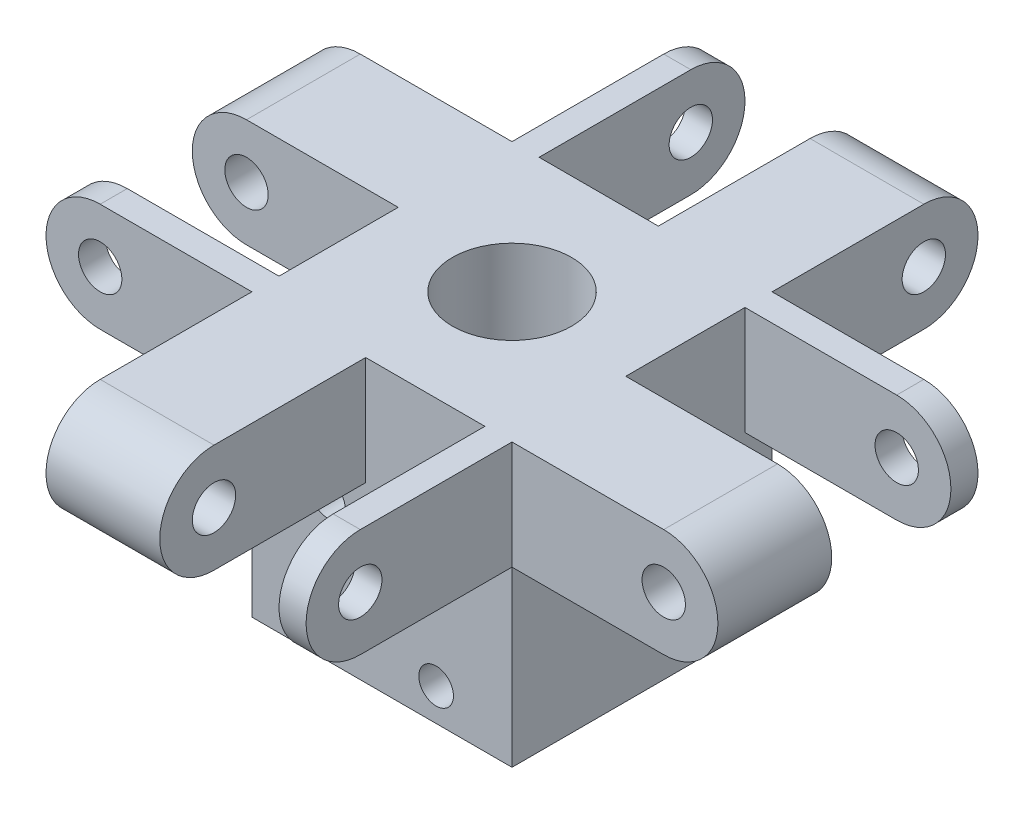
ISO-10303-21;
HEADER;
FILE_DESCRIPTION(('STEP AP214'),'2;1');
FILE_NAME('part.step','',(''),(''),'','','');
FILE_SCHEMA(('AUTOMOTIVE_DESIGN { 1 0 10303 214 1 1 1 1 }'));
ENDSEC;
DATA;
#1=APPLICATION_CONTEXT('core data for automotive mechanical design processes');
#2=APPLICATION_PROTOCOL_DEFINITION('international standard','automotive_design',2000,#1);
#3=PRODUCT_CONTEXT('',#1,'mechanical');
#4=PRODUCT('Part','Part','',(#3));
#5=PRODUCT_RELATED_PRODUCT_CATEGORY('part','',(#4));
#6=PRODUCT_DEFINITION_FORMATION('','',#4);
#7=PRODUCT_DEFINITION_CONTEXT('part definition',#1,'design');
#8=PRODUCT_DEFINITION('design','',#6,#7);
#9=PRODUCT_DEFINITION_SHAPE('','',#8);
#10=(LENGTH_UNIT() NAMED_UNIT(*) SI_UNIT(.MILLI.,.METRE.));
#11=(NAMED_UNIT(*) PLANE_ANGLE_UNIT() SI_UNIT($,.RADIAN.));
#12=(NAMED_UNIT(*) SI_UNIT($,.STERADIAN.) SOLID_ANGLE_UNIT());
#13=UNCERTAINTY_MEASURE_WITH_UNIT(LENGTH_MEASURE(1.E-05),#10,'distance_accuracy_value','');
#14=(GEOMETRIC_REPRESENTATION_CONTEXT(3) GLOBAL_UNCERTAINTY_ASSIGNED_CONTEXT((#13)) GLOBAL_UNIT_ASSIGNED_CONTEXT((#10,
#11,#12)) REPRESENTATION_CONTEXT('',''));
#15=CARTESIAN_POINT('',(0.,0.,0.));
#16=DIRECTION('',(0.,0.,1.));
#17=DIRECTION('',(1.,0.,0.));
#18=AXIS2_PLACEMENT_3D('',#15,#16,#17);
#19=CARTESIAN_POINT('',(-12.,21.,-26.));
#20=DIRECTION('',(1.,0.,0.));
#21=DIRECTION('',(0.,0.,-1.));
#22=AXIS2_PLACEMENT_3D('',#19,#20,#21);
#23=CYLINDRICAL_SURFACE('',#22,5.);
#24=CARTESIAN_POINT('',(-9.49999999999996,21.,-26.));
#25=DIRECTION('',(-1.,0.,0.));
#26=DIRECTION('',(0.,0.,1.));
#27=AXIS2_PLACEMENT_3D('',#24,#25,#26);
#28=CIRCLE('',#27,5.);
#29=CARTESIAN_POINT('',(-9.49999999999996,16.,-26.));
#30=VERTEX_POINT('',#29);
#31=CARTESIAN_POINT('',(-9.49999999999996,26.,-26.));
#32=VERTEX_POINT('',#31);
#33=EDGE_CURVE('E325',#30,#32,#28,.F.);
#34=ORIENTED_EDGE('',*,*,#33,.F.);
#35=DIRECTION('',(1.,0.,0.));
#36=VECTOR('',#35,1.);
#37=CARTESIAN_POINT('',(-12.,16.,-26.));
#38=LINE('',#37,#36);
#39=CARTESIAN_POINT('',(-12.,16.,-26.));
#40=VERTEX_POINT('',#39);
#41=EDGE_CURVE('E422',#40,#30,#38,.T.);
#42=ORIENTED_EDGE('',*,*,#41,.F.);
#43=CARTESIAN_POINT('',(-12.,21.,-26.));
#44=DIRECTION('',(1.,0.,0.));
#45=DIRECTION('',(0.,0.,1.));
#46=AXIS2_PLACEMENT_3D('',#43,#44,#45);
#47=CIRCLE('',#46,5.);
#48=CARTESIAN_POINT('',(-12.,26.,-26.));
#49=VERTEX_POINT('',#48);
#50=EDGE_CURVE('E441',#40,#49,#47,.T.);
#51=ORIENTED_EDGE('',*,*,#50,.T.);
#52=DIRECTION('',(1.,0.,0.));
#53=VECTOR('',#52,1.);
#54=CARTESIAN_POINT('',(-12.,26.,-26.));
#55=LINE('',#54,#53);
#56=EDGE_CURVE('E427',#49,#32,#55,.T.);
#57=ORIENTED_EDGE('',*,*,#56,.T.);
#58=EDGE_LOOP('',(#34,#42,#51,#57));
#59=FACE_BOUND('',#58,.T.);
#60=ADVANCED_FACE('F35',(#59),#23,.T.);
#61=CARTESIAN_POINT('',(-12.,16.,-26.));
#62=DIRECTION('',(0.,-1.,0.));
#63=DIRECTION('',(0.,0.,-1.));
#64=AXIS2_PLACEMENT_3D('',#61,#62,#63);
#65=PLANE('',#64);
#66=DIRECTION('',(0.,0.,-1.));
#67=VECTOR('',#66,1.);
#68=CARTESIAN_POINT('',(-9.49999999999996,16.,-26.));
#69=LINE('',#68,#67);
#70=CARTESIAN_POINT('',(-9.49999999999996,16.,-12.0000000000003));
#71=VERTEX_POINT('',#70);
#72=EDGE_CURVE('E322',#71,#30,#69,.T.);
#73=ORIENTED_EDGE('',*,*,#72,.F.);
#74=DIRECTION('',(1.,0.,0.));
#75=VECTOR('',#74,1.);
#76=CARTESIAN_POINT('',(-12.,16.,-12.));
#77=LINE('',#76,#75);
#78=CARTESIAN_POINT('',(-12.,16.,-12.));
#79=VERTEX_POINT('',#78);
#80=EDGE_CURVE('E417',#79,#71,#77,.T.);
#81=ORIENTED_EDGE('',*,*,#80,.F.);
#82=DIRECTION('',(0.,0.,-1.));
#83=VECTOR('',#82,1.);
#84=CARTESIAN_POINT('',(-12.,16.,-26.));
#85=LINE('',#84,#83);
#86=EDGE_CURVE('E430',#79,#40,#85,.T.);
#87=ORIENTED_EDGE('',*,*,#86,.T.);
#88=ORIENTED_EDGE('',*,*,#41,.T.);
#89=EDGE_LOOP('',(#73,#81,#87,#88));
#90=FACE_BOUND('',#89,.T.);
#91=ADVANCED_FACE('F639',(#90),#65,.T.);
#92=CARTESIAN_POINT('',(-12.,21.,-26.));
#93=DIRECTION('',(1.,0.,0.));
#94=DIRECTION('',(0.,0.,-1.));
#95=AXIS2_PLACEMENT_3D('',#92,#93,#94);
#96=CYLINDRICAL_SURFACE('',#95,2.00000000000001);
#97=CARTESIAN_POINT('',(-9.49999999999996,21.,-26.));
#98=DIRECTION('',(-1.,0.,0.));
#99=DIRECTION('',(0.,0.,1.));
#100=AXIS2_PLACEMENT_3D('',#97,#98,#99);
#101=CIRCLE('',#100,2.00000000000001);
#102=CARTESIAN_POINT('',(-9.49999999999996,21.,-24.));
#103=VERTEX_POINT('',#102);
#104=EDGE_CURVE('E39',#103,#103,#101,.F.);
#105=ORIENTED_EDGE('',*,*,#104,.T.);
#106=EDGE_LOOP('',(#105));
#107=FACE_BOUND('',#106,.T.);
#108=CARTESIAN_POINT('',(-12.,21.,-26.));
#109=DIRECTION('',(1.,0.,0.));
#110=DIRECTION('',(0.,0.,-1.));
#111=AXIS2_PLACEMENT_3D('',#108,#109,#110);
#112=CIRCLE('',#111,2.00000000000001);
#113=CARTESIAN_POINT('',(-12.,21.,-28.));
#114=VERTEX_POINT('',#113);
#115=EDGE_CURVE('E425',#114,#114,#112,.T.);
#116=ORIENTED_EDGE('',*,*,#115,.F.);
#117=EDGE_LOOP('',(#116));
#118=FACE_BOUND('',#117,.T.);
#119=ADVANCED_FACE('F646',(#107,#118),#96,.F.);
#120=CARTESIAN_POINT('',(26.0000000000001,21.,-11.9999999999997));
#121=DIRECTION('',(0.,0.,1.));
#122=DIRECTION('',(1.,0.,0.));
#123=AXIS2_PLACEMENT_3D('',#120,#121,#122);
#124=CYLINDRICAL_SURFACE('',#123,5.);
#125=CARTESIAN_POINT('',(26.0000000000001,21.,-9.49999999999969));
#126=DIRECTION('',(0.,0.,-1.));
#127=DIRECTION('',(-1.,0.,0.));
#128=AXIS2_PLACEMENT_3D('',#125,#126,#127);
#129=CIRCLE('',#128,5.);
#130=CARTESIAN_POINT('',(26.0000000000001,16.,-9.49999999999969));
#131=VERTEX_POINT('',#130);
#132=CARTESIAN_POINT('',(26.,26.,-9.49999999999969));
#133=VERTEX_POINT('',#132);
#134=EDGE_CURVE('E314',#131,#133,#129,.F.);
#135=ORIENTED_EDGE('',*,*,#134,.F.);
#136=DIRECTION('',(0.,0.,1.));
#137=VECTOR('',#136,1.);
#138=CARTESIAN_POINT('',(26.0000000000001,16.,-11.9999999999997));
#139=LINE('',#138,#137);
#140=CARTESIAN_POINT('',(26.0000000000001,16.,-11.9999999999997));
#141=VERTEX_POINT('',#140);
#142=EDGE_CURVE('E381',#141,#131,#139,.T.);
#143=ORIENTED_EDGE('',*,*,#142,.F.);
#144=CARTESIAN_POINT('',(26.0000000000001,21.,-11.9999999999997));
#145=DIRECTION('',(0.,0.,1.));
#146=DIRECTION('',(-1.,0.,0.));
#147=AXIS2_PLACEMENT_3D('',#144,#145,#146);
#148=CIRCLE('',#147,5.);
#149=CARTESIAN_POINT('',(26.0000000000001,26.,-11.9999999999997));
#150=VERTEX_POINT('',#149);
#151=EDGE_CURVE('E405',#141,#150,#148,.T.);
#152=ORIENTED_EDGE('',*,*,#151,.T.);
#153=DIRECTION('',(0.,0.,1.));
#154=VECTOR('',#153,1.);
#155=CARTESIAN_POINT('',(26.0000000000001,26.,-11.9999999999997));
#156=LINE('',#155,#154);
#157=EDGE_CURVE('E386',#150,#133,#156,.T.);
#158=ORIENTED_EDGE('',*,*,#157,.T.);
#159=EDGE_LOOP('',(#135,#143,#152,#158));
#160=FACE_BOUND('',#159,.T.);
#161=ADVANCED_FACE('F733',(#160),#124,.T.);
#162=CARTESIAN_POINT('',(26.0000000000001,16.,-11.9999999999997));
#163=DIRECTION('',(0.,-1.,0.));
#164=DIRECTION('',(0.,0.,-1.));
#165=AXIS2_PLACEMENT_3D('',#162,#163,#164);
#166=PLANE('',#165);
#167=DIRECTION('',(1.,0.,0.));
#168=VECTOR('',#167,1.);
#169=CARTESIAN_POINT('',(26.0000000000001,16.,-9.49999999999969));
#170=LINE('',#169,#168);
#171=CARTESIAN_POINT('',(12.0000000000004,16.,-9.49999999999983));
#172=VERTEX_POINT('',#171);
#173=EDGE_CURVE('E311',#172,#131,#170,.T.);
#174=ORIENTED_EDGE('',*,*,#173,.F.);
#175=DIRECTION('',(0.,0.,1.));
#176=VECTOR('',#175,1.);
#177=CARTESIAN_POINT('',(12.0000000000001,16.,-11.9999999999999));
#178=LINE('',#177,#176);
#179=CARTESIAN_POINT('',(12.0000000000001,16.,-11.9999999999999));
#180=VERTEX_POINT('',#179);
#181=EDGE_CURVE('E376',#180,#172,#178,.T.);
#182=ORIENTED_EDGE('',*,*,#181,.F.);
#183=DIRECTION('',(1.,0.,0.));
#184=VECTOR('',#183,1.);
#185=CARTESIAN_POINT('',(26.0000000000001,16.,-11.9999999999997));
#186=LINE('',#185,#184);
#187=EDGE_CURVE('E389',#180,#141,#186,.T.);
#188=ORIENTED_EDGE('',*,*,#187,.T.);
#189=ORIENTED_EDGE('',*,*,#142,.T.);
#190=EDGE_LOOP('',(#174,#182,#188,#189));
#191=FACE_BOUND('',#190,.T.);
#192=ADVANCED_FACE('F690',(#191),#166,.T.);
#193=CARTESIAN_POINT('',(26.0000000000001,21.,-11.9999999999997));
#194=DIRECTION('',(0.,0.,1.));
#195=DIRECTION('',(1.,0.,0.));
#196=AXIS2_PLACEMENT_3D('',#193,#194,#195);
#197=CYLINDRICAL_SURFACE('',#196,2.00000000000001);
#198=CARTESIAN_POINT('',(26.0000000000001,21.,-9.49999999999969));
#199=DIRECTION('',(0.,0.,-1.));
#200=DIRECTION('',(-1.,0.,0.));
#201=AXIS2_PLACEMENT_3D('',#198,#199,#200);
#202=CIRCLE('',#201,2.00000000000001);
#203=CARTESIAN_POINT('',(24.0000000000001,21.,-9.49999999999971));
#204=VERTEX_POINT('',#203);
#205=EDGE_CURVE('E310',#204,#204,#202,.F.);
#206=ORIENTED_EDGE('',*,*,#205,.T.);
#207=EDGE_LOOP('',(#206));
#208=FACE_BOUND('',#207,.T.);
#209=CARTESIAN_POINT('',(26.0000000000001,21.,-11.9999999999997));
#210=DIRECTION('',(0.,0.,1.));
#211=DIRECTION('',(1.,0.,0.));
#212=AXIS2_PLACEMENT_3D('',#209,#210,#211);
#213=CIRCLE('',#212,2.00000000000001);
#214=CARTESIAN_POINT('',(28.0000000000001,21.,-11.9999999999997));
#215=VERTEX_POINT('',#214);
#216=EDGE_CURVE('E384',#215,#215,#213,.T.);
#217=ORIENTED_EDGE('',*,*,#216,.F.);
#218=EDGE_LOOP('',(#217));
#219=FACE_BOUND('',#218,.T.);
#220=ADVANCED_FACE('F873',(#208,#219),#197,.F.);
#221=CARTESIAN_POINT('',(-26.,21.,11.9999999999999));
#222=DIRECTION('',(0.,0.,-1.));
#223=DIRECTION('',(-1.,0.,0.));
#224=AXIS2_PLACEMENT_3D('',#221,#222,#223);
#225=CYLINDRICAL_SURFACE('',#224,5.);
#226=CARTESIAN_POINT('',(-26.,21.,9.49999999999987));
#227=DIRECTION('',(0.,0.,1.));
#228=DIRECTION('',(1.,0.,0.));
#229=AXIS2_PLACEMENT_3D('',#226,#227,#228);
#230=CIRCLE('',#229,5.);
#231=CARTESIAN_POINT('',(-26.,16.,9.49999999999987));
#232=VERTEX_POINT('',#231);
#233=CARTESIAN_POINT('',(-26.,26.,9.49999999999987));
#234=VERTEX_POINT('',#233);
#235=EDGE_CURVE('E349',#232,#234,#230,.F.);
#236=ORIENTED_EDGE('',*,*,#235,.F.);
#237=DIRECTION('',(0.,0.,-1.));
#238=VECTOR('',#237,1.);
#239=CARTESIAN_POINT('',(-26.,16.,11.9999999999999));
#240=LINE('',#239,#238);
#241=CARTESIAN_POINT('',(-26.,16.,11.9999999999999));
#242=VERTEX_POINT('',#241);
#243=EDGE_CURVE('E482',#242,#232,#240,.T.);
#244=ORIENTED_EDGE('',*,*,#243,.F.);
#245=CARTESIAN_POINT('',(-26.,21.,11.9999999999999));
#246=DIRECTION('',(0.,0.,-1.));
#247=DIRECTION('',(1.,0.,0.));
#248=AXIS2_PLACEMENT_3D('',#245,#246,#247);
#249=CIRCLE('',#248,5.);
#250=CARTESIAN_POINT('',(-26.,26.,11.9999999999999));
#251=VERTEX_POINT('',#250);
#252=EDGE_CURVE('E466',#242,#251,#249,.T.);
#253=ORIENTED_EDGE('',*,*,#252,.T.);
#254=DIRECTION('',(0.,0.,-1.));
#255=VECTOR('',#254,1.);
#256=CARTESIAN_POINT('',(-26.,26.,11.9999999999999));
#257=LINE('',#256,#255);
#258=EDGE_CURVE('E477',#251,#234,#257,.T.);
#259=ORIENTED_EDGE('',*,*,#258,.T.);
#260=EDGE_LOOP('',(#236,#244,#253,#259));
#261=FACE_BOUND('',#260,.T.);
#262=ADVANCED_FACE('F749',(#261),#225,.T.);
#263=CARTESIAN_POINT('',(-26.,16.,11.9999999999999));
#264=DIRECTION('',(0.,-1.,0.));
#265=DIRECTION('',(0.,0.,-1.));
#266=AXIS2_PLACEMENT_3D('',#263,#264,#265);
#267=PLANE('',#266);
#268=DIRECTION('',(-1.,0.,0.));
#269=VECTOR('',#268,1.);
#270=CARTESIAN_POINT('',(-26.,16.,9.49999999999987));
#271=LINE('',#270,#269);
#272=CARTESIAN_POINT('',(-12.0000000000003,16.,9.49999999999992));
#273=VERTEX_POINT('',#272);
#274=EDGE_CURVE('E346',#273,#232,#271,.T.);
#275=ORIENTED_EDGE('',*,*,#274,.F.);
#276=DIRECTION('',(0.,0.,-1.));
#277=VECTOR('',#276,1.);
#278=CARTESIAN_POINT('',(-12.,16.,12.));
#279=LINE('',#278,#277);
#280=CARTESIAN_POINT('',(-12.,16.,12.));
#281=VERTEX_POINT('',#280);
#282=EDGE_CURVE('E486',#281,#273,#279,.T.);
#283=ORIENTED_EDGE('',*,*,#282,.F.);
#284=DIRECTION('',(-1.,0.,0.));
#285=VECTOR('',#284,1.);
#286=CARTESIAN_POINT('',(-26.,16.,11.9999999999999));
#287=LINE('',#286,#285);
#288=EDGE_CURVE('E462',#281,#242,#287,.T.);
#289=ORIENTED_EDGE('',*,*,#288,.T.);
#290=ORIENTED_EDGE('',*,*,#243,.T.);
#291=EDGE_LOOP('',(#275,#283,#289,#290));
#292=FACE_BOUND('',#291,.T.);
#293=ADVANCED_FACE('F752',(#292),#267,.T.);
#294=CARTESIAN_POINT('',(-26.,21.,11.9999999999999));
#295=DIRECTION('',(0.,0.,-1.));
#296=DIRECTION('',(-1.,0.,0.));
#297=AXIS2_PLACEMENT_3D('',#294,#295,#296);
#298=CYLINDRICAL_SURFACE('',#297,2.00000000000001);
#299=CARTESIAN_POINT('',(-26.,21.,9.49999999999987));
#300=DIRECTION('',(0.,0.,1.));
#301=DIRECTION('',(1.,0.,0.));
#302=AXIS2_PLACEMENT_3D('',#299,#300,#301);
#303=CIRCLE('',#302,2.00000000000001);
#304=CARTESIAN_POINT('',(-24.,21.,9.49999999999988));
#305=VERTEX_POINT('',#304);
#306=EDGE_CURVE('E345',#305,#305,#303,.F.);
#307=ORIENTED_EDGE('',*,*,#306,.T.);
#308=EDGE_LOOP('',(#307));
#309=FACE_BOUND('',#308,.T.);
#310=CARTESIAN_POINT('',(-26.,21.,11.9999999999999));
#311=DIRECTION('',(0.,0.,-1.));
#312=DIRECTION('',(-1.,0.,0.));
#313=AXIS2_PLACEMENT_3D('',#310,#311,#312);
#314=CIRCLE('',#313,2.00000000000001);
#315=CARTESIAN_POINT('',(-28.,21.,11.9999999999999));
#316=VERTEX_POINT('',#315);
#317=EDGE_CURVE('E453',#316,#316,#314,.T.);
#318=ORIENTED_EDGE('',*,*,#317,.F.);
#319=EDGE_LOOP('',(#318));
#320=FACE_BOUND('',#319,.T.);
#321=ADVANCED_FACE('F663',(#309,#320),#298,.F.);
#322=CARTESIAN_POINT('',(12.,21.,26.));
#323=DIRECTION('',(-1.,0.,0.));
#324=DIRECTION('',(0.,0.,1.));
#325=AXIS2_PLACEMENT_3D('',#322,#323,#324);
#326=CYLINDRICAL_SURFACE('',#325,5.);
#327=CARTESIAN_POINT('',(9.49999999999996,21.,26.));
#328=DIRECTION('',(1.,0.,0.));
#329=DIRECTION('',(0.,0.,-1.));
#330=AXIS2_PLACEMENT_3D('',#327,#328,#329);
#331=CIRCLE('',#330,5.);
#332=CARTESIAN_POINT('',(9.49999999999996,16.,26.));
#333=VERTEX_POINT('',#332);
#334=CARTESIAN_POINT('',(9.49999999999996,26.,26.));
#335=VERTEX_POINT('',#334);
#336=EDGE_CURVE('E373',#333,#335,#331,.F.);
#337=ORIENTED_EDGE('',*,*,#336,.F.);
#338=DIRECTION('',(-1.,0.,0.));
#339=VECTOR('',#338,1.);
#340=CARTESIAN_POINT('',(12.,16.,26.));
#341=LINE('',#340,#339);
#342=CARTESIAN_POINT('',(12.,16.,26.));
#343=VERTEX_POINT('',#342);
#344=EDGE_CURVE('E512',#343,#333,#341,.T.);
#345=ORIENTED_EDGE('',*,*,#344,.F.);
#346=CARTESIAN_POINT('',(12.,21.,26.));
#347=DIRECTION('',(-1.,0.,0.));
#348=DIRECTION('',(0.,0.,-1.));
#349=AXIS2_PLACEMENT_3D('',#346,#347,#348);
#350=CIRCLE('',#349,5.);
#351=CARTESIAN_POINT('',(12.,26.,26.));
#352=VERTEX_POINT('',#351);
#353=EDGE_CURVE('E498',#343,#352,#350,.T.);
#354=ORIENTED_EDGE('',*,*,#353,.T.);
#355=DIRECTION('',(-1.,0.,0.));
#356=VECTOR('',#355,1.);
#357=CARTESIAN_POINT('',(12.,26.,26.));
#358=LINE('',#357,#356);
#359=EDGE_CURVE('E507',#352,#335,#358,.T.);
#360=ORIENTED_EDGE('',*,*,#359,.T.);
#361=EDGE_LOOP('',(#337,#345,#354,#360));
#362=FACE_BOUND('',#361,.T.);
#363=ADVANCED_FACE('F763',(#362),#326,.T.);
#364=CARTESIAN_POINT('',(12.,16.,26.));
#365=DIRECTION('',(0.,-1.,0.));
#366=DIRECTION('',(0.,0.,-1.));
#367=AXIS2_PLACEMENT_3D('',#364,#365,#366);
#368=PLANE('',#367);
#369=DIRECTION('',(0.,0.,1.));
#370=VECTOR('',#369,1.);
#371=CARTESIAN_POINT('',(9.49999999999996,16.,26.));
#372=LINE('',#371,#370);
#373=CARTESIAN_POINT('',(9.49999999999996,16.,12.0000000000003));
#374=VERTEX_POINT('',#373);
#375=EDGE_CURVE('E370',#374,#333,#372,.T.);
#376=ORIENTED_EDGE('',*,*,#375,.F.);
#377=DIRECTION('',(-1.,0.,0.));
#378=VECTOR('',#377,1.);
#379=CARTESIAN_POINT('',(12.,16.,12.));
#380=LINE('',#379,#378);
#381=CARTESIAN_POINT('',(12.,16.,12.));
#382=VERTEX_POINT('',#381);
#383=EDGE_CURVE('E516',#382,#374,#380,.T.);
#384=ORIENTED_EDGE('',*,*,#383,.F.);
#385=DIRECTION('',(0.,0.,1.));
#386=VECTOR('',#385,1.);
#387=CARTESIAN_POINT('',(12.,16.,26.));
#388=LINE('',#387,#386);
#389=EDGE_CURVE('E495',#382,#343,#388,.T.);
#390=ORIENTED_EDGE('',*,*,#389,.T.);
#391=ORIENTED_EDGE('',*,*,#344,.T.);
#392=EDGE_LOOP('',(#376,#384,#390,#391));
#393=FACE_BOUND('',#392,.T.);
#394=ADVANCED_FACE('F767',(#393),#368,.T.);
#395=CARTESIAN_POINT('',(12.,21.,26.));
#396=DIRECTION('',(-1.,0.,0.));
#397=DIRECTION('',(0.,0.,1.));
#398=AXIS2_PLACEMENT_3D('',#395,#396,#397);
#399=CYLINDRICAL_SURFACE('',#398,2.00000000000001);
#400=CARTESIAN_POINT('',(9.49999999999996,21.,26.));
#401=DIRECTION('',(1.,0.,0.));
#402=DIRECTION('',(0.,0.,-1.));
#403=AXIS2_PLACEMENT_3D('',#400,#401,#402);
#404=CIRCLE('',#403,2.00000000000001);
#405=CARTESIAN_POINT('',(9.49999999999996,21.,24.));
#406=VERTEX_POINT('',#405);
#407=EDGE_CURVE('E369',#406,#406,#404,.F.);
#408=ORIENTED_EDGE('',*,*,#407,.T.);
#409=EDGE_LOOP('',(#408));
#410=FACE_BOUND('',#409,.T.);
#411=CARTESIAN_POINT('',(12.,21.,26.));
#412=DIRECTION('',(-1.,0.,0.));
#413=DIRECTION('',(0.,0.,1.));
#414=AXIS2_PLACEMENT_3D('',#411,#412,#413);
#415=CIRCLE('',#414,2.00000000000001);
#416=CARTESIAN_POINT('',(12.,21.,28.));
#417=VERTEX_POINT('',#416);
#418=EDGE_CURVE('E489',#417,#417,#415,.T.);
#419=ORIENTED_EDGE('',*,*,#418,.F.);
#420=EDGE_LOOP('',(#419));
#421=FACE_BOUND('',#420,.T.);
#422=ADVANCED_FACE('F757',(#410,#421),#399,.F.);
#423=CARTESIAN_POINT('',(12.,26.,12.));
#424=DIRECTION('',(-1.,0.,0.));
#425=DIRECTION('',(0.,0.,1.));
#426=AXIS2_PLACEMENT_3D('',#423,#424,#425);
#427=PLANE('',#426);
#428=ORIENTED_EDGE('',*,*,#418,.T.);
#429=EDGE_LOOP('',(#428));
#430=FACE_BOUND('',#429,.T.);
#431=DIRECTION('',(0.,-1.,0.));
#432=VECTOR('',#431,1.);
#433=CARTESIAN_POINT('',(11.9999999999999,26.,12.0000000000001));
#434=LINE('',#433,#432);
#435=CARTESIAN_POINT('',(11.9999999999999,26.,12.0000000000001));
#436=VERTEX_POINT('',#435);
#437=EDGE_CURVE('E400',#436,#382,#434,.T.);
#438=ORIENTED_EDGE('',*,*,#437,.F.);
#439=DIRECTION('',(0.,0.,-1.));
#440=VECTOR('',#439,1.);
#441=CARTESIAN_POINT('',(12.,26.,12.));
#442=LINE('',#441,#440);
#443=EDGE_CURVE('E578',#352,#436,#442,.T.);
#444=ORIENTED_EDGE('',*,*,#443,.F.);
#445=ORIENTED_EDGE('',*,*,#353,.F.);
#446=ORIENTED_EDGE('',*,*,#389,.F.);
#447=EDGE_LOOP('',(#438,#444,#445,#446));
#448=FACE_BOUND('',#447,.T.);
#449=ADVANCED_FACE('F811',(#430,#448),#427,.F.);
#450=CARTESIAN_POINT('',(12.,21.,-26.));
#451=DIRECTION('',(1.,0.,0.));
#452=DIRECTION('',(0.,0.,-1.));
#453=AXIS2_PLACEMENT_3D('',#450,#451,#452);
#454=CIRCLE('',#453,2.00000000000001);
#455=CARTESIAN_POINT('',(12.,21.,-28.));
#456=VERTEX_POINT('',#455);
#457=EDGE_CURVE('E435',#456,#456,#454,.T.);
#458=ORIENTED_EDGE('',*,*,#457,.F.);
#459=EDGE_LOOP('',(#458));
#460=FACE_BOUND('',#459,.T.);
#461=CARTESIAN_POINT('',(12.0000000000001,26.,-11.9999999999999));
#462=VERTEX_POINT('',#461);
#463=CARTESIAN_POINT('',(12.,26.,-26.));
#464=VERTEX_POINT('',#463);
#465=EDGE_CURVE('E582',#462,#464,#442,.T.);
#466=ORIENTED_EDGE('',*,*,#465,.F.);
#467=DIRECTION('',(0.,-1.,0.));
#468=VECTOR('',#467,1.);
#469=CARTESIAN_POINT('',(12.0000000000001,26.,-11.9999999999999));
#470=LINE('',#469,#468);
#471=EDGE_CURVE('E375',#462,#180,#470,.T.);
#472=ORIENTED_EDGE('',*,*,#471,.T.);
#473=DIRECTION('',(0.,0.,-1.));
#474=VECTOR('',#473,1.);
#475=CARTESIAN_POINT('',(12.,16.,-26.));
#476=LINE('',#475,#474);
#477=CARTESIAN_POINT('',(12.,16.,-26.));
#478=VERTEX_POINT('',#477);
#479=EDGE_CURVE('E436',#180,#478,#476,.T.);
#480=ORIENTED_EDGE('',*,*,#479,.T.);
#481=CARTESIAN_POINT('',(12.,21.,-26.));
#482=DIRECTION('',(1.,0.,0.));
#483=DIRECTION('',(0.,0.,1.));
#484=AXIS2_PLACEMENT_3D('',#481,#482,#483);
#485=CIRCLE('',#484,5.);
#486=EDGE_CURVE('E432',#478,#464,#485,.T.);
#487=ORIENTED_EDGE('',*,*,#486,.T.);
#488=EDGE_LOOP('',(#466,#472,#480,#487));
#489=FACE_BOUND('',#488,.T.);
#490=ADVANCED_FACE('F682',(#460,#489),#427,.F.);
#491=CARTESIAN_POINT('',(-12.,26.,-12.));
#492=DIRECTION('',(0.,0.,1.));
#493=DIRECTION('',(1.,0.,0.));
#494=AXIS2_PLACEMENT_3D('',#491,#492,#493);
#495=PLANE('',#494);
#496=CARTESIAN_POINT('',(-26.,21.,-12.0000000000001));
#497=DIRECTION('',(0.,0.,-1.));
#498=DIRECTION('',(-1.,0.,0.));
#499=AXIS2_PLACEMENT_3D('',#496,#497,#498);
#500=CIRCLE('',#499,2.00000000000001);
#501=CARTESIAN_POINT('',(-28.,21.,-12.0000000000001));
#502=VERTEX_POINT('',#501);
#503=EDGE_CURVE('E450',#502,#502,#500,.T.);
#504=ORIENTED_EDGE('',*,*,#503,.F.);
#505=EDGE_LOOP('',(#504));
#506=FACE_BOUND('',#505,.T.);
#507=DIRECTION('',(-1.,0.,0.));
#508=VECTOR('',#507,1.);
#509=CARTESIAN_POINT('',(-12.,26.,-12.));
#510=LINE('',#509,#508);
#511=CARTESIAN_POINT('',(-12.,26.,-12.));
#512=VERTEX_POINT('',#511);
#513=CARTESIAN_POINT('',(-26.,26.,-12.0000000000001));
#514=VERTEX_POINT('',#513);
#515=EDGE_CURVE('E581',#512,#514,#510,.T.);
#516=ORIENTED_EDGE('',*,*,#515,.F.);
#517=DIRECTION('',(0.,-1.,0.));
#518=VECTOR('',#517,1.);
#519=CARTESIAN_POINT('',(-12.,26.,-12.));
#520=LINE('',#519,#518);
#521=EDGE_CURVE('E414',#512,#79,#520,.T.);
#522=ORIENTED_EDGE('',*,*,#521,.T.);
#523=DIRECTION('',(-1.,0.,0.));
#524=VECTOR('',#523,1.);
#525=CARTESIAN_POINT('',(-26.,16.,-12.0000000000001));
#526=LINE('',#525,#524);
#527=CARTESIAN_POINT('',(-26.,16.,-12.0000000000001));
#528=VERTEX_POINT('',#527);
#529=EDGE_CURVE('E456',#79,#528,#526,.T.);
#530=ORIENTED_EDGE('',*,*,#529,.T.);
#531=CARTESIAN_POINT('',(-26.,21.,-12.0000000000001));
#532=DIRECTION('',(0.,0.,-1.));
#533=DIRECTION('',(1.,0.,0.));
#534=AXIS2_PLACEMENT_3D('',#531,#532,#533);
#535=CIRCLE('',#534,5.);
#536=EDGE_CURVE('E463',#528,#514,#535,.T.);
#537=ORIENTED_EDGE('',*,*,#536,.T.);
#538=EDGE_LOOP('',(#516,#522,#530,#537));
#539=FACE_BOUND('',#538,.T.);
#540=ADVANCED_FACE('F716',(#506,#539),#495,.F.);
#541=CARTESIAN_POINT('',(-12.,26.,12.));
#542=DIRECTION('',(1.,0.,0.));
#543=DIRECTION('',(0.,0.,-1.));
#544=AXIS2_PLACEMENT_3D('',#541,#542,#543);
#545=PLANE('',#544);
#546=CARTESIAN_POINT('',(-12.,21.,26.));
#547=DIRECTION('',(-1.,0.,0.));
#548=DIRECTION('',(0.,0.,1.));
#549=AXIS2_PLACEMENT_3D('',#546,#547,#548);
#550=CIRCLE('',#549,2.00000000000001);
#551=CARTESIAN_POINT('',(-12.,21.,28.));
#552=VERTEX_POINT('',#551);
#553=EDGE_CURVE('E480',#552,#552,#550,.T.);
#554=ORIENTED_EDGE('',*,*,#553,.F.);
#555=EDGE_LOOP('',(#554));
#556=FACE_BOUND('',#555,.T.);
#557=DIRECTION('',(0.,0.,1.));
#558=VECTOR('',#557,1.);
#559=CARTESIAN_POINT('',(-12.,26.,12.));
#560=LINE('',#559,#558);
#561=CARTESIAN_POINT('',(-12.,26.,12.));
#562=VERTEX_POINT('',#561);
#563=CARTESIAN_POINT('',(-12.,26.,26.));
#564=VERTEX_POINT('',#563);
#565=EDGE_CURVE('E585',#562,#564,#560,.T.);
#566=ORIENTED_EDGE('',*,*,#565,.F.);
#567=DIRECTION('',(0.,-1.,0.));
#568=VECTOR('',#567,1.);
#569=CARTESIAN_POINT('',(-12.,26.,12.));
#570=LINE('',#569,#568);
#571=EDGE_CURVE('E459',#562,#281,#570,.T.);
#572=ORIENTED_EDGE('',*,*,#571,.T.);
#573=DIRECTION('',(0.,0.,1.));
#574=VECTOR('',#573,1.);
#575=CARTESIAN_POINT('',(-12.,16.,26.));
#576=LINE('',#575,#574);
#577=CARTESIAN_POINT('',(-12.,16.,26.));
#578=VERTEX_POINT('',#577);
#579=EDGE_CURVE('E492',#281,#578,#576,.T.);
#580=ORIENTED_EDGE('',*,*,#579,.T.);
#581=CARTESIAN_POINT('',(-12.,21.,26.));
#582=DIRECTION('',(-1.,0.,0.));
#583=DIRECTION('',(0.,0.,-1.));
#584=AXIS2_PLACEMENT_3D('',#581,#582,#583);
#585=CIRCLE('',#584,5.);
#586=EDGE_CURVE('E499',#578,#564,#585,.T.);
#587=ORIENTED_EDGE('',*,*,#586,.T.);
#588=EDGE_LOOP('',(#566,#572,#580,#587));
#589=FACE_BOUND('',#588,.T.);
#590=ADVANCED_FACE('F800',(#556,#589),#545,.F.);
#591=CARTESIAN_POINT('',(0.,26.,0.));
#592=DIRECTION('',(0.,-1.,0.));
#593=DIRECTION('',(0.,0.,-1.));
#594=AXIS2_PLACEMENT_3D('',#591,#592,#593);
#595=PLANE('',#594);
#596=DIRECTION('',(1.,0.,0.));
#597=VECTOR('',#596,1.);
#598=CARTESIAN_POINT('',(-9.49999999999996,26.,-12.0000000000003));
#599=LINE('',#598,#597);
#600=CARTESIAN_POINT('',(-9.49999999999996,26.,-12.0000000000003));
#601=VERTEX_POINT('',#600);
#602=CARTESIAN_POINT('',(1.50000000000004,26.,-12.0000000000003));
#603=VERTEX_POINT('',#602);
#604=EDGE_CURVE('E287',#601,#603,#599,.T.);
#605=ORIENTED_EDGE('',*,*,#604,.F.);
#606=DIRECTION('',(0.,0.,1.));
#607=VECTOR('',#606,1.);
#608=CARTESIAN_POINT('',(-9.49999999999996,26.,-31.0000000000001));
#609=LINE('',#608,#607);
#610=EDGE_CURVE('E284',#32,#601,#609,.T.);
#611=ORIENTED_EDGE('',*,*,#610,.F.);
#612=ORIENTED_EDGE('',*,*,#56,.F.);
#613=DIRECTION('',(0.,0.,1.));
#614=VECTOR('',#613,1.);
#615=CARTESIAN_POINT('',(-12.,26.,-12.));
#616=LINE('',#615,#614);
#617=EDGE_CURVE('E420',#49,#512,#616,.T.);
#618=ORIENTED_EDGE('',*,*,#617,.T.);
#619=ORIENTED_EDGE('',*,*,#515,.T.);
#620=CARTESIAN_POINT('',(-26.,26.,-1.50000000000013));
#621=VERTEX_POINT('',#620);
#622=EDGE_CURVE('E481',#621,#514,#257,.T.);
#623=ORIENTED_EDGE('',*,*,#622,.F.);
#624=DIRECTION('',(-1.,0.,0.));
#625=VECTOR('',#624,1.);
#626=CARTESIAN_POINT('',(-12.0000000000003,26.,-1.50000000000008));
#627=LINE('',#626,#625);
#628=CARTESIAN_POINT('',(-12.0000000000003,26.,-1.50000000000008));
#629=VERTEX_POINT('',#628);
#630=EDGE_CURVE('E333',#629,#621,#627,.T.);
#631=ORIENTED_EDGE('',*,*,#630,.F.);
#632=DIRECTION('',(0.,0.,-1.));
#633=VECTOR('',#632,1.);
#634=CARTESIAN_POINT('',(-12.0000000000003,26.,9.49999999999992));
#635=LINE('',#634,#633);
#636=CARTESIAN_POINT('',(-12.0000000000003,26.,9.49999999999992));
#637=VERTEX_POINT('',#636);
#638=EDGE_CURVE('E330',#637,#629,#635,.T.);
#639=ORIENTED_EDGE('',*,*,#638,.F.);
#640=DIRECTION('',(1.,0.,0.));
#641=VECTOR('',#640,1.);
#642=CARTESIAN_POINT('',(-31.0000000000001,26.,9.49999999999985));
#643=LINE('',#642,#641);
#644=EDGE_CURVE('E327',#234,#637,#643,.T.);
#645=ORIENTED_EDGE('',*,*,#644,.F.);
#646=ORIENTED_EDGE('',*,*,#258,.F.);
#647=DIRECTION('',(1.,0.,0.));
#648=VECTOR('',#647,1.);
#649=CARTESIAN_POINT('',(-12.,26.,12.));
#650=LINE('',#649,#648);
#651=EDGE_CURVE('E469',#251,#562,#650,.T.);
#652=ORIENTED_EDGE('',*,*,#651,.T.);
#653=ORIENTED_EDGE('',*,*,#565,.T.);
#654=CARTESIAN_POINT('',(-1.50000000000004,26.,26.));
#655=VERTEX_POINT('',#654);
#656=EDGE_CURVE('E511',#655,#564,#358,.T.);
#657=ORIENTED_EDGE('',*,*,#656,.F.);
#658=DIRECTION('',(0.,0.,1.));
#659=VECTOR('',#658,1.);
#660=CARTESIAN_POINT('',(-1.50000000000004,26.,12.0000000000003));
#661=LINE('',#660,#659);
#662=CARTESIAN_POINT('',(-1.50000000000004,26.,12.0000000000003));
#663=VERTEX_POINT('',#662);
#664=EDGE_CURVE('E357',#663,#655,#661,.T.);
#665=ORIENTED_EDGE('',*,*,#664,.F.);
#666=DIRECTION('',(-1.,0.,0.));
#667=VECTOR('',#666,1.);
#668=CARTESIAN_POINT('',(9.49999999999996,26.,12.0000000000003));
#669=LINE('',#668,#667);
#670=CARTESIAN_POINT('',(9.49999999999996,26.,12.0000000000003));
#671=VERTEX_POINT('',#670);
#672=EDGE_CURVE('E354',#671,#663,#669,.T.);
#673=ORIENTED_EDGE('',*,*,#672,.F.);
#674=DIRECTION('',(0.,0.,-1.));
#675=VECTOR('',#674,1.);
#676=CARTESIAN_POINT('',(9.49999999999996,26.,31.0000000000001));
#677=LINE('',#676,#675);
#678=EDGE_CURVE('E351',#335,#671,#677,.T.);
#679=ORIENTED_EDGE('',*,*,#678,.F.);
#680=ORIENTED_EDGE('',*,*,#359,.F.);
#681=ORIENTED_EDGE('',*,*,#443,.T.);
#682=DIRECTION('',(-1.,0.,0.));
#683=VECTOR('',#682,1.);
#684=CARTESIAN_POINT('',(11.9999999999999,26.,12.0000000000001));
#685=LINE('',#684,#683);
#686=CARTESIAN_POINT('',(25.9999999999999,26.,12.0000000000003));
#687=VERTEX_POINT('',#686);
#688=EDGE_CURVE('E391',#687,#436,#685,.T.);
#689=ORIENTED_EDGE('',*,*,#688,.F.);
#690=CARTESIAN_POINT('',(26.,26.,1.50000000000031));
#691=VERTEX_POINT('',#690);
#692=EDGE_CURVE('E390',#691,#687,#156,.T.);
#693=ORIENTED_EDGE('',*,*,#692,.F.);
#694=DIRECTION('',(1.,0.,0.));
#695=VECTOR('',#694,1.);
#696=CARTESIAN_POINT('',(12.0000000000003,26.,1.50000000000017));
#697=LINE('',#696,#695);
#698=CARTESIAN_POINT('',(12.0000000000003,26.,1.50000000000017));
#699=VERTEX_POINT('',#698);
#700=EDGE_CURVE('E300',#699,#691,#697,.T.);
#701=ORIENTED_EDGE('',*,*,#700,.F.);
#702=DIRECTION('',(0.,0.,1.));
#703=VECTOR('',#702,1.);
#704=CARTESIAN_POINT('',(12.0000000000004,26.,-9.49999999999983));
#705=LINE('',#704,#703);
#706=CARTESIAN_POINT('',(12.0000000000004,26.,-9.49999999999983));
#707=VERTEX_POINT('',#706);
#708=EDGE_CURVE('E280',#707,#699,#705,.T.);
#709=ORIENTED_EDGE('',*,*,#708,.F.);
#710=DIRECTION('',(-1.,0.,0.));
#711=VECTOR('',#710,1.);
#712=CARTESIAN_POINT('',(31.0000000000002,26.,-9.49999999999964));
#713=LINE('',#712,#711);
#714=EDGE_CURVE('E277',#133,#707,#713,.T.);
#715=ORIENTED_EDGE('',*,*,#714,.F.);
#716=ORIENTED_EDGE('',*,*,#157,.F.);
#717=DIRECTION('',(-1.,0.,0.));
#718=VECTOR('',#717,1.);
#719=CARTESIAN_POINT('',(12.0000000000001,26.,-11.9999999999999));
#720=LINE('',#719,#718);
#721=EDGE_CURVE('E379',#150,#462,#720,.T.);
#722=ORIENTED_EDGE('',*,*,#721,.T.);
#723=ORIENTED_EDGE('',*,*,#465,.T.);
#724=CARTESIAN_POINT('',(1.50000000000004,26.,-26.));
#725=VERTEX_POINT('',#724);
#726=EDGE_CURVE('E431',#725,#464,#55,.T.);
#727=ORIENTED_EDGE('',*,*,#726,.F.);
#728=DIRECTION('',(0.,0.,-1.));
#729=VECTOR('',#728,1.);
#730=CARTESIAN_POINT('',(1.50000000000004,26.,-12.0000000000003));
#731=LINE('',#730,#729);
#732=EDGE_CURVE('E291',#603,#725,#731,.T.);
#733=ORIENTED_EDGE('',*,*,#732,.F.);
#734=EDGE_LOOP('',(#605,#611,#612,#618,#619,#623,#631,#639,#645,#646,#652,#653,#657,#665,#673,
#679,#680,#681,#689,#693,#701,#709,#715,#716,#722,#723,#727,#733));
#735=FACE_BOUND('',#734,.T.);
#736=CARTESIAN_POINT('',(0.,26.,0.));
#737=DIRECTION('',(0.,1.,0.));
#738=DIRECTION('',(0.,0.,1.));
#739=AXIS2_PLACEMENT_3D('',#736,#737,#738);
#740=CIRCLE('',#739,5.5);
#741=CARTESIAN_POINT('',(0.,26.,5.5));
#742=VERTEX_POINT('',#741);
#743=EDGE_CURVE('E1264',#742,#742,#740,.T.);
#744=ORIENTED_EDGE('',*,*,#743,.F.);
#745=EDGE_LOOP('',(#744));
#746=FACE_BOUND('',#745,.T.);
#747=ADVANCED_FACE('F675',(#735,#746),#595,.F.);
#748=CARTESIAN_POINT('',(0.,0.,0.));
#749=DIRECTION('',(0.,-1.,0.));
#750=DIRECTION('',(0.,0.,-1.));
#751=AXIS2_PLACEMENT_3D('',#748,#749,#750);
#752=PLANE('',#751);
#753=DIRECTION('',(0.,0.,-1.));
#754=VECTOR('',#753,1.);
#755=CARTESIAN_POINT('',(12.,0.,12.));
#756=LINE('',#755,#754);
#757=CARTESIAN_POINT('',(12.,0.,12.));
#758=VERTEX_POINT('',#757);
#759=CARTESIAN_POINT('',(12.,0.,-12.));
#760=VERTEX_POINT('',#759);
#761=EDGE_CURVE('E577',#758,#760,#756,.T.);
#762=ORIENTED_EDGE('',*,*,#761,.F.);
#763=DIRECTION('',(1.,0.,0.));
#764=VECTOR('',#763,1.);
#765=CARTESIAN_POINT('',(-12.,0.,12.));
#766=LINE('',#765,#764);
#767=CARTESIAN_POINT('',(-12.,0.,12.));
#768=VERTEX_POINT('',#767);
#769=EDGE_CURVE('E597',#768,#758,#766,.T.);
#770=ORIENTED_EDGE('',*,*,#769,.F.);
#771=DIRECTION('',(0.,0.,1.));
#772=VECTOR('',#771,1.);
#773=CARTESIAN_POINT('',(-12.,0.,12.));
#774=LINE('',#773,#772);
#775=CARTESIAN_POINT('',(-12.,0.,-12.));
#776=VERTEX_POINT('',#775);
#777=EDGE_CURVE('E594',#776,#768,#774,.T.);
#778=ORIENTED_EDGE('',*,*,#777,.F.);
#779=DIRECTION('',(-1.,0.,0.));
#780=VECTOR('',#779,1.);
#781=CARTESIAN_POINT('',(-12.,0.,-12.));
#782=LINE('',#781,#780);
#783=EDGE_CURVE('E591',#760,#776,#782,.T.);
#784=ORIENTED_EDGE('',*,*,#783,.F.);
#785=EDGE_LOOP('',(#762,#770,#778,#784));
#786=FACE_BOUND('',#785,.T.);
#787=DIRECTION('',(1.,0.,0.));
#788=VECTOR('',#787,1.);
#789=CARTESIAN_POINT('',(-9.,0.,9.));
#790=LINE('',#789,#788);
#791=CARTESIAN_POINT('',(-9.,0.,9.));
#792=VERTEX_POINT('',#791);
#793=CARTESIAN_POINT('',(9.,0.,9.));
#794=VERTEX_POINT('',#793);
#795=EDGE_CURVE('E264',#792,#794,#790,.T.);
#796=ORIENTED_EDGE('',*,*,#795,.T.);
#797=DIRECTION('',(0.,0.,-1.));
#798=VECTOR('',#797,1.);
#799=CARTESIAN_POINT('',(9.,0.,9.));
#800=LINE('',#799,#798);
#801=CARTESIAN_POINT('',(9.,0.,-9.));
#802=VERTEX_POINT('',#801);
#803=EDGE_CURVE('E564',#794,#802,#800,.T.);
#804=ORIENTED_EDGE('',*,*,#803,.T.);
#805=DIRECTION('',(-1.,0.,0.));
#806=VECTOR('',#805,1.);
#807=CARTESIAN_POINT('',(-9.,0.,-9.));
#808=LINE('',#807,#806);
#809=CARTESIAN_POINT('',(-9.,0.,-9.));
#810=VERTEX_POINT('',#809);
#811=EDGE_CURVE('E567',#802,#810,#808,.T.);
#812=ORIENTED_EDGE('',*,*,#811,.T.);
#813=DIRECTION('',(0.,0.,1.));
#814=VECTOR('',#813,1.);
#815=CARTESIAN_POINT('',(-9.,0.,9.));
#816=LINE('',#815,#814);
#817=EDGE_CURVE('E570',#810,#792,#816,.T.);
#818=ORIENTED_EDGE('',*,*,#817,.T.);
#819=EDGE_LOOP('',(#796,#804,#812,#818));
#820=FACE_BOUND('',#819,.T.);
#821=ADVANCED_FACE('F700',(#786,#820),#752,.T.);
#822=DIRECTION('',(0.,1.,0.));
#823=VECTOR('',#822,1.);
#824=CARTESIAN_POINT('',(12.0000000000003,4.,1.50000000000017));
#825=LINE('',#824,#823);
#826=CARTESIAN_POINT('',(12.,16.,1.50000000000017));
#827=VERTEX_POINT('',#826);
#828=EDGE_CURVE('E288',#827,#699,#825,.T.);
#829=ORIENTED_EDGE('',*,*,#828,.F.);
#830=EDGE_CURVE('E380',#827,#382,#178,.T.);
#831=ORIENTED_EDGE('',*,*,#830,.T.);
#832=DIRECTION('',(0.,-1.,0.));
#833=VECTOR('',#832,1.);
#834=CARTESIAN_POINT('',(12.,26.,12.));
#835=LINE('',#834,#833);
#836=EDGE_CURVE('E588',#382,#758,#835,.T.);
#837=ORIENTED_EDGE('',*,*,#836,.T.);
#838=ORIENTED_EDGE('',*,*,#761,.T.);
#839=DIRECTION('',(0.,-1.,0.));
#840=VECTOR('',#839,1.);
#841=CARTESIAN_POINT('',(12.,26.,-12.));
#842=LINE('',#841,#840);
#843=EDGE_CURVE('E11',#180,#760,#842,.T.);
#844=ORIENTED_EDGE('',*,*,#843,.F.);
#845=ORIENTED_EDGE('',*,*,#181,.T.);
#846=DIRECTION('',(0.,1.,0.));
#847=VECTOR('',#846,1.);
#848=CARTESIAN_POINT('',(12.0000000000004,4.,-9.49999999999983));
#849=LINE('',#848,#847);
#850=EDGE_CURVE('E302',#172,#707,#849,.T.);
#851=ORIENTED_EDGE('',*,*,#850,.T.);
#852=ORIENTED_EDGE('',*,*,#708,.T.);
#853=EDGE_LOOP('',(#829,#831,#837,#838,#844,#845,#851,#852));
#854=FACE_BOUND('',#853,.T.);
#855=ADVANCED_FACE('F37',(#854),#427,.F.);
#856=DIRECTION('',(0.,1.,0.));
#857=VECTOR('',#856,1.);
#858=CARTESIAN_POINT('',(1.50000000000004,4.,-12.0000000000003));
#859=LINE('',#858,#857);
#860=CARTESIAN_POINT('',(1.50000000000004,16.,-12.));
#861=VERTEX_POINT('',#860);
#862=EDGE_CURVE('E294',#861,#603,#859,.T.);
#863=ORIENTED_EDGE('',*,*,#862,.F.);
#864=EDGE_CURVE('E421',#861,#180,#77,.T.);
#865=ORIENTED_EDGE('',*,*,#864,.T.);
#866=ORIENTED_EDGE('',*,*,#843,.T.);
#867=ORIENTED_EDGE('',*,*,#783,.T.);
#868=DIRECTION('',(0.,-1.,0.));
#869=VECTOR('',#868,1.);
#870=CARTESIAN_POINT('',(-12.,26.,-12.));
#871=LINE('',#870,#869);
#872=EDGE_CURVE('E44',#79,#776,#871,.T.);
#873=ORIENTED_EDGE('',*,*,#872,.F.);
#874=ORIENTED_EDGE('',*,*,#80,.T.);
#875=DIRECTION('',(0.,1.,0.));
#876=VECTOR('',#875,1.);
#877=CARTESIAN_POINT('',(-9.49999999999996,4.,-12.0000000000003));
#878=LINE('',#877,#876);
#879=EDGE_CURVE('E293',#71,#601,#878,.T.);
#880=ORIENTED_EDGE('',*,*,#879,.T.);
#881=ORIENTED_EDGE('',*,*,#604,.T.);
#882=EDGE_LOOP('',(#863,#865,#866,#867,#873,#874,#880,#881));
#883=FACE_BOUND('',#882,.T.);
#884=CARTESIAN_POINT('',(-5.,3.,-12.));
#885=DIRECTION('',(0.,0.,1.));
#886=DIRECTION('',(1.,0.,0.));
#887=AXIS2_PLACEMENT_3D('',#884,#885,#886);
#888=CIRCLE('',#887,1.59999999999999);
#889=CARTESIAN_POINT('',(-3.4,3.,-12.));
#890=VERTEX_POINT('',#889);
#891=EDGE_CURVE('E555',#890,#890,#888,.T.);
#892=ORIENTED_EDGE('',*,*,#891,.T.);
#893=EDGE_LOOP('',(#892));
#894=FACE_BOUND('',#893,.T.);
#895=CARTESIAN_POINT('',(5.,13.,-12.));
#896=DIRECTION('',(0.,0.,1.));
#897=DIRECTION('',(1.,0.,0.));
#898=AXIS2_PLACEMENT_3D('',#895,#896,#897);
#899=CIRCLE('',#898,1.59999999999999);
#900=CARTESIAN_POINT('',(6.59999999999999,13.,-12.));
#901=VERTEX_POINT('',#900);
#902=EDGE_CURVE('E533',#901,#901,#899,.T.);
#903=ORIENTED_EDGE('',*,*,#902,.T.);
#904=EDGE_LOOP('',(#903));
#905=FACE_BOUND('',#904,.T.);
#906=CARTESIAN_POINT('',(5.,3.,-12.));
#907=DIRECTION('',(0.,0.,1.));
#908=DIRECTION('',(1.,0.,0.));
#909=AXIS2_PLACEMENT_3D('',#906,#907,#908);
#910=CIRCLE('',#909,1.59999999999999);
#911=CARTESIAN_POINT('',(6.59999999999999,3.,-12.));
#912=VERTEX_POINT('',#911);
#913=EDGE_CURVE('E545',#912,#912,#910,.T.);
#914=ORIENTED_EDGE('',*,*,#913,.T.);
#915=EDGE_LOOP('',(#914));
#916=FACE_BOUND('',#915,.T.);
#917=CARTESIAN_POINT('',(-5.,13.,-12.));
#918=DIRECTION('',(0.,0.,1.));
#919=DIRECTION('',(1.,0.,0.));
#920=AXIS2_PLACEMENT_3D('',#917,#918,#919);
#921=CIRCLE('',#920,1.59999999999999);
#922=CARTESIAN_POINT('',(-3.4,13.,-12.));
#923=VERTEX_POINT('',#922);
#924=EDGE_CURVE('E521',#923,#923,#921,.T.);
#925=ORIENTED_EDGE('',*,*,#924,.T.);
#926=EDGE_LOOP('',(#925));
#927=FACE_BOUND('',#926,.T.);
#928=ADVANCED_FACE('F695',(#883,#894,#905,#916,#927),#495,.F.);
#929=DIRECTION('',(0.,1.,0.));
#930=VECTOR('',#929,1.);
#931=CARTESIAN_POINT('',(-12.0000000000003,4.,-1.50000000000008));
#932=LINE('',#931,#930);
#933=CARTESIAN_POINT('',(-12.,16.,-1.50000000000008));
#934=VERTEX_POINT('',#933);
#935=EDGE_CURVE('E336',#934,#629,#932,.T.);
#936=ORIENTED_EDGE('',*,*,#935,.F.);
#937=EDGE_CURVE('E472',#934,#79,#279,.T.);
#938=ORIENTED_EDGE('',*,*,#937,.T.);
#939=ORIENTED_EDGE('',*,*,#872,.T.);
#940=ORIENTED_EDGE('',*,*,#777,.T.);
#941=DIRECTION('',(0.,-1.,0.));
#942=VECTOR('',#941,1.);
#943=CARTESIAN_POINT('',(-12.,26.,12.));
#944=LINE('',#943,#942);
#945=EDGE_CURVE('E601',#281,#768,#944,.T.);
#946=ORIENTED_EDGE('',*,*,#945,.F.);
#947=ORIENTED_EDGE('',*,*,#282,.T.);
#948=DIRECTION('',(0.,1.,0.));
#949=VECTOR('',#948,1.);
#950=CARTESIAN_POINT('',(-12.0000000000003,4.,9.49999999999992));
#951=LINE('',#950,#949);
#952=EDGE_CURVE('E335',#273,#637,#951,.T.);
#953=ORIENTED_EDGE('',*,*,#952,.T.);
#954=ORIENTED_EDGE('',*,*,#638,.T.);
#955=EDGE_LOOP('',(#936,#938,#939,#940,#946,#947,#953,#954));
#956=FACE_BOUND('',#955,.T.);
#957=ADVANCED_FACE('F705',(#956),#545,.F.);
#958=CARTESIAN_POINT('',(-12.,26.,12.));
#959=DIRECTION('',(0.,0.,-1.));
#960=DIRECTION('',(-1.,0.,0.));
#961=AXIS2_PLACEMENT_3D('',#958,#959,#960);
#962=PLANE('',#961);
#963=DIRECTION('',(0.,1.,0.));
#964=VECTOR('',#963,1.);
#965=CARTESIAN_POINT('',(-1.50000000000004,4.,12.0000000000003));
#966=LINE('',#965,#964);
#967=CARTESIAN_POINT('',(-1.50000000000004,16.,12.));
#968=VERTEX_POINT('',#967);
#969=EDGE_CURVE('E360',#968,#663,#966,.T.);
#970=ORIENTED_EDGE('',*,*,#969,.F.);
#971=EDGE_CURVE('E502',#968,#281,#380,.T.);
#972=ORIENTED_EDGE('',*,*,#971,.T.);
#973=ORIENTED_EDGE('',*,*,#945,.T.);
#974=ORIENTED_EDGE('',*,*,#769,.T.);
#975=ORIENTED_EDGE('',*,*,#836,.F.);
#976=ORIENTED_EDGE('',*,*,#383,.T.);
#977=DIRECTION('',(0.,1.,0.));
#978=VECTOR('',#977,1.);
#979=CARTESIAN_POINT('',(9.49999999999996,4.,12.0000000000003));
#980=LINE('',#979,#978);
#981=EDGE_CURVE('E359',#374,#671,#980,.T.);
#982=ORIENTED_EDGE('',*,*,#981,.T.);
#983=ORIENTED_EDGE('',*,*,#672,.T.);
#984=EDGE_LOOP('',(#970,#972,#973,#974,#975,#976,#982,#983));
#985=FACE_BOUND('',#984,.T.);
#986=CARTESIAN_POINT('',(5.,3.,12.));
#987=DIRECTION('',(0.,0.,1.));
#988=DIRECTION('',(1.,0.,0.));
#989=AXIS2_PLACEMENT_3D('',#986,#987,#988);
#990=CIRCLE('',#989,1.59999999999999);
#991=CARTESIAN_POINT('',(6.59999999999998,3.,12.));
#992=VERTEX_POINT('',#991);
#993=EDGE_CURVE('E542',#992,#992,#990,.T.);
#994=ORIENTED_EDGE('',*,*,#993,.F.);
#995=EDGE_LOOP('',(#994));
#996=FACE_BOUND('',#995,.T.);
#997=CARTESIAN_POINT('',(-5.,13.,12.));
#998=DIRECTION('',(0.,0.,1.));
#999=DIRECTION('',(1.,0.,0.));
#1000=AXIS2_PLACEMENT_3D('',#997,#998,#999);
#1001=CIRCLE('',#1000,1.59999999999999);
#1002=CARTESIAN_POINT('',(-3.40000000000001,13.,12.));
#1003=VERTEX_POINT('',#1002);
#1004=EDGE_CURVE('E510',#1003,#1003,#1001,.T.);
#1005=ORIENTED_EDGE('',*,*,#1004,.F.);
#1006=EDGE_LOOP('',(#1005));
#1007=FACE_BOUND('',#1006,.T.);
#1008=CARTESIAN_POINT('',(-5.,3.,12.));
#1009=DIRECTION('',(0.,0.,1.));
#1010=DIRECTION('',(1.,0.,0.));
#1011=AXIS2_PLACEMENT_3D('',#1008,#1009,#1010);
#1012=CIRCLE('',#1011,1.59999999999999);
#1013=CARTESIAN_POINT('',(-3.40000000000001,3.,12.));
#1014=VERTEX_POINT('',#1013);
#1015=EDGE_CURVE('E552',#1014,#1014,#1012,.T.);
#1016=ORIENTED_EDGE('',*,*,#1015,.F.);
#1017=EDGE_LOOP('',(#1016));
#1018=FACE_BOUND('',#1017,.T.);
#1019=CARTESIAN_POINT('',(5.,13.,12.));
#1020=DIRECTION('',(0.,0.,1.));
#1021=DIRECTION('',(1.,0.,0.));
#1022=AXIS2_PLACEMENT_3D('',#1019,#1020,#1021);
#1023=CIRCLE('',#1022,1.59999999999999);
#1024=CARTESIAN_POINT('',(6.59999999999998,13.,12.));
#1025=VERTEX_POINT('',#1024);
#1026=EDGE_CURVE('E530',#1025,#1025,#1023,.T.);
#1027=ORIENTED_EDGE('',*,*,#1026,.F.);
#1028=EDGE_LOOP('',(#1027));
#1029=FACE_BOUND('',#1028,.T.);
#1030=ADVANCED_FACE('F797',(#985,#996,#1007,#1018,#1029),#962,.F.);
#1031=CARTESIAN_POINT('',(9.,26.,9.));
#1032=DIRECTION('',(-1.,0.,0.));
#1033=DIRECTION('',(0.,0.,1.));
#1034=AXIS2_PLACEMENT_3D('',#1031,#1032,#1033);
#1035=PLANE('',#1034);
#1036=DIRECTION('',(0.,0.,-1.));
#1037=VECTOR('',#1036,1.);
#1038=CARTESIAN_POINT('',(9.,17.,9.));
#1039=LINE('',#1038,#1037);
#1040=CARTESIAN_POINT('',(9.,17.,9.));
#1041=VERTEX_POINT('',#1040);
#1042=CARTESIAN_POINT('',(9.,17.,-9.));
#1043=VERTEX_POINT('',#1042);
#1044=EDGE_CURVE('E52',#1041,#1043,#1039,.T.);
#1045=ORIENTED_EDGE('',*,*,#1044,.T.);
#1046=DIRECTION('',(0.,-1.,0.));
#1047=VECTOR('',#1046,1.);
#1048=CARTESIAN_POINT('',(9.,26.,-9.));
#1049=LINE('',#1048,#1047);
#1050=EDGE_CURVE('E575',#1043,#802,#1049,.T.);
#1051=ORIENTED_EDGE('',*,*,#1050,.T.);
#1052=ORIENTED_EDGE('',*,*,#803,.F.);
#1053=DIRECTION('',(0.,-1.,0.));
#1054=VECTOR('',#1053,1.);
#1055=CARTESIAN_POINT('',(9.,26.,9.));
#1056=LINE('',#1055,#1054);
#1057=EDGE_CURVE('E269',#1041,#794,#1056,.T.);
#1058=ORIENTED_EDGE('',*,*,#1057,.F.);
#1059=EDGE_LOOP('',(#1045,#1051,#1052,#1058));
#1060=FACE_BOUND('',#1059,.T.);
#1061=ADVANCED_FACE('F794',(#1060),#1035,.T.);
#1062=CARTESIAN_POINT('',(-9.,26.,-9.));
#1063=DIRECTION('',(0.,0.,1.));
#1064=DIRECTION('',(1.,0.,0.));
#1065=AXIS2_PLACEMENT_3D('',#1062,#1063,#1064);
#1066=PLANE('',#1065);
#1067=DIRECTION('',(-1.,0.,0.));
#1068=VECTOR('',#1067,1.);
#1069=CARTESIAN_POINT('',(-9.,17.,-9.));
#1070=LINE('',#1069,#1068);
#1071=CARTESIAN_POINT('',(-9.,17.,-9.));
#1072=VERTEX_POINT('',#1071);
#1073=EDGE_CURVE('E59',#1043,#1072,#1070,.T.);
#1074=ORIENTED_EDGE('',*,*,#1073,.T.);
#1075=DIRECTION('',(0.,-1.,0.));
#1076=VECTOR('',#1075,1.);
#1077=CARTESIAN_POINT('',(-9.,26.,-9.));
#1078=LINE('',#1077,#1076);
#1079=EDGE_CURVE('E268',#1072,#810,#1078,.T.);
#1080=ORIENTED_EDGE('',*,*,#1079,.T.);
#1081=ORIENTED_EDGE('',*,*,#811,.F.);
#1082=ORIENTED_EDGE('',*,*,#1050,.F.);
#1083=EDGE_LOOP('',(#1074,#1080,#1081,#1082));
#1084=FACE_BOUND('',#1083,.T.);
#1085=CARTESIAN_POINT('',(-5.,13.,-9.));
#1086=DIRECTION('',(0.,0.,1.));
#1087=DIRECTION('',(1.,0.,0.));
#1088=AXIS2_PLACEMENT_3D('',#1085,#1086,#1087);
#1089=CIRCLE('',#1088,1.59999999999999);
#1090=CARTESIAN_POINT('',(-3.40000000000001,13.,-9.));
#1091=VERTEX_POINT('',#1090);
#1092=EDGE_CURVE('E527',#1091,#1091,#1089,.T.);
#1093=ORIENTED_EDGE('',*,*,#1092,.F.);
#1094=EDGE_LOOP('',(#1093));
#1095=FACE_BOUND('',#1094,.T.);
#1096=CARTESIAN_POINT('',(5.,13.,-9.));
#1097=DIRECTION('',(0.,0.,1.));
#1098=DIRECTION('',(1.,0.,0.));
#1099=AXIS2_PLACEMENT_3D('',#1096,#1097,#1098);
#1100=CIRCLE('',#1099,1.59999999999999);
#1101=CARTESIAN_POINT('',(6.59999999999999,13.,-9.));
#1102=VERTEX_POINT('',#1101);
#1103=EDGE_CURVE('E539',#1102,#1102,#1100,.T.);
#1104=ORIENTED_EDGE('',*,*,#1103,.F.);
#1105=EDGE_LOOP('',(#1104));
#1106=FACE_BOUND('',#1105,.T.);
#1107=CARTESIAN_POINT('',(5.,3.,-9.));
#1108=DIRECTION('',(0.,0.,1.));
#1109=DIRECTION('',(1.,0.,0.));
#1110=AXIS2_PLACEMENT_3D('',#1107,#1108,#1109);
#1111=CIRCLE('',#1110,1.59999999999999);
#1112=CARTESIAN_POINT('',(6.59999999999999,3.,-9.));
#1113=VERTEX_POINT('',#1112);
#1114=EDGE_CURVE('E548',#1113,#1113,#1111,.T.);
#1115=ORIENTED_EDGE('',*,*,#1114,.F.);
#1116=EDGE_LOOP('',(#1115));
#1117=FACE_BOUND('',#1116,.T.);
#1118=CARTESIAN_POINT('',(-5.,3.,-9.));
#1119=DIRECTION('',(0.,0.,1.));
#1120=DIRECTION('',(1.,0.,0.));
#1121=AXIS2_PLACEMENT_3D('',#1118,#1119,#1120);
#1122=CIRCLE('',#1121,1.59999999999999);
#1123=CARTESIAN_POINT('',(-3.40000000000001,3.,-9.));
#1124=VERTEX_POINT('',#1123);
#1125=EDGE_CURVE('E561',#1124,#1124,#1122,.T.);
#1126=ORIENTED_EDGE('',*,*,#1125,.F.);
#1127=EDGE_LOOP('',(#1126));
#1128=FACE_BOUND('',#1127,.T.);
#1129=ADVANCED_FACE('F791',(#1084,#1095,#1106,#1117,#1128),#1066,.T.);
#1130=CARTESIAN_POINT('',(-9.,26.,9.));
#1131=DIRECTION('',(1.,0.,0.));
#1132=DIRECTION('',(0.,0.,-1.));
#1133=AXIS2_PLACEMENT_3D('',#1130,#1131,#1132);
#1134=PLANE('',#1133);
#1135=DIRECTION('',(0.,0.,1.));
#1136=VECTOR('',#1135,1.);
#1137=CARTESIAN_POINT('',(-9.,17.,9.));
#1138=LINE('',#1137,#1136);
#1139=CARTESIAN_POINT('',(-9.,17.,9.));
#1140=VERTEX_POINT('',#1139);
#1141=EDGE_CURVE('E272',#1072,#1140,#1138,.T.);
#1142=ORIENTED_EDGE('',*,*,#1141,.T.);
#1143=DIRECTION('',(0.,-1.,0.));
#1144=VECTOR('',#1143,1.);
#1145=CARTESIAN_POINT('',(-9.,26.,9.));
#1146=LINE('',#1145,#1144);
#1147=EDGE_CURVE('E257',#1140,#792,#1146,.T.);
#1148=ORIENTED_EDGE('',*,*,#1147,.T.);
#1149=ORIENTED_EDGE('',*,*,#817,.F.);
#1150=ORIENTED_EDGE('',*,*,#1079,.F.);
#1151=EDGE_LOOP('',(#1142,#1148,#1149,#1150));
#1152=FACE_BOUND('',#1151,.T.);
#1153=ADVANCED_FACE('F273',(#1152),#1134,.T.);
#1154=CARTESIAN_POINT('',(-9.,26.,9.));
#1155=DIRECTION('',(0.,0.,-1.));
#1156=DIRECTION('',(-1.,0.,0.));
#1157=AXIS2_PLACEMENT_3D('',#1154,#1155,#1156);
#1158=PLANE('',#1157);
#1159=DIRECTION('',(1.,0.,0.));
#1160=VECTOR('',#1159,1.);
#1161=CARTESIAN_POINT('',(-9.,17.,9.));
#1162=LINE('',#1161,#1160);
#1163=EDGE_CURVE('E262',#1140,#1041,#1162,.T.);
#1164=ORIENTED_EDGE('',*,*,#1163,.T.);
#1165=ORIENTED_EDGE('',*,*,#1057,.T.);
#1166=ORIENTED_EDGE('',*,*,#795,.F.);
#1167=ORIENTED_EDGE('',*,*,#1147,.F.);
#1168=EDGE_LOOP('',(#1164,#1165,#1166,#1167));
#1169=FACE_BOUND('',#1168,.T.);
#1170=CARTESIAN_POINT('',(-5.,13.,9.));
#1171=DIRECTION('',(0.,0.,-1.));
#1172=DIRECTION('',(-1.,0.,0.));
#1173=AXIS2_PLACEMENT_3D('',#1170,#1171,#1172);
#1174=CIRCLE('',#1173,1.59999999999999);
#1175=CARTESIAN_POINT('',(-6.59999999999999,13.,9.));
#1176=VERTEX_POINT('',#1175);
#1177=EDGE_CURVE('E524',#1176,#1176,#1174,.T.);
#1178=ORIENTED_EDGE('',*,*,#1177,.F.);
#1179=EDGE_LOOP('',(#1178));
#1180=FACE_BOUND('',#1179,.T.);
#1181=CARTESIAN_POINT('',(5.,13.,9.));
#1182=DIRECTION('',(0.,0.,-1.));
#1183=DIRECTION('',(-1.,0.,0.));
#1184=AXIS2_PLACEMENT_3D('',#1181,#1182,#1183);
#1185=CIRCLE('',#1184,1.59999999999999);
#1186=CARTESIAN_POINT('',(3.40000000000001,13.,9.));
#1187=VERTEX_POINT('',#1186);
#1188=EDGE_CURVE('E536',#1187,#1187,#1185,.T.);
#1189=ORIENTED_EDGE('',*,*,#1188,.F.);
#1190=EDGE_LOOP('',(#1189));
#1191=FACE_BOUND('',#1190,.T.);
#1192=CARTESIAN_POINT('',(5.,3.,9.));
#1193=DIRECTION('',(0.,0.,-1.));
#1194=DIRECTION('',(-1.,0.,0.));
#1195=AXIS2_PLACEMENT_3D('',#1192,#1193,#1194);
#1196=CIRCLE('',#1195,1.59999999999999);
#1197=CARTESIAN_POINT('',(3.40000000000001,3.,9.));
#1198=VERTEX_POINT('',#1197);
#1199=EDGE_CURVE('E549',#1198,#1198,#1196,.T.);
#1200=ORIENTED_EDGE('',*,*,#1199,.F.);
#1201=EDGE_LOOP('',(#1200));
#1202=FACE_BOUND('',#1201,.T.);
#1203=CARTESIAN_POINT('',(-5.,3.,9.));
#1204=DIRECTION('',(0.,0.,-1.));
#1205=DIRECTION('',(-1.,0.,0.));
#1206=AXIS2_PLACEMENT_3D('',#1203,#1204,#1205);
#1207=CIRCLE('',#1206,1.59999999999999);
#1208=CARTESIAN_POINT('',(-6.59999999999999,3.,9.));
#1209=VERTEX_POINT('',#1208);
#1210=EDGE_CURVE('E558',#1209,#1209,#1207,.T.);
#1211=ORIENTED_EDGE('',*,*,#1210,.F.);
#1212=EDGE_LOOP('',(#1211));
#1213=FACE_BOUND('',#1212,.T.);
#1214=ADVANCED_FACE('F259',(#1169,#1180,#1191,#1202,#1213),#1158,.T.);
#1215=CARTESIAN_POINT('',(-5.,3.,12.));
#1216=DIRECTION('',(0.,0.,1.));
#1217=DIRECTION('',(1.,0.,0.));
#1218=AXIS2_PLACEMENT_3D('',#1215,#1216,#1217);
#1219=CYLINDRICAL_SURFACE('',#1218,1.59999999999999);
#1220=ORIENTED_EDGE('',*,*,#1210,.T.);
#1221=EDGE_LOOP('',(#1220));
#1222=FACE_BOUND('',#1221,.T.);
#1223=ORIENTED_EDGE('',*,*,#1015,.T.);
#1224=EDGE_LOOP('',(#1223));
#1225=FACE_BOUND('',#1224,.T.);
#1226=ADVANCED_FACE('F783',(#1222,#1225),#1219,.F.);
#1227=ORIENTED_EDGE('',*,*,#1125,.T.);
#1228=EDGE_LOOP('',(#1227));
#1229=FACE_BOUND('',#1228,.T.);
#1230=ORIENTED_EDGE('',*,*,#891,.F.);
#1231=EDGE_LOOP('',(#1230));
#1232=FACE_BOUND('',#1231,.T.);
#1233=ADVANCED_FACE('F781',(#1229,#1232),#1219,.F.);
#1234=CARTESIAN_POINT('',(5.,3.,12.));
#1235=DIRECTION('',(0.,0.,1.));
#1236=DIRECTION('',(1.,0.,0.));
#1237=AXIS2_PLACEMENT_3D('',#1234,#1235,#1236);
#1238=CYLINDRICAL_SURFACE('',#1237,1.59999999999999);
#1239=ORIENTED_EDGE('',*,*,#1114,.T.);
#1240=EDGE_LOOP('',(#1239));
#1241=FACE_BOUND('',#1240,.T.);
#1242=ORIENTED_EDGE('',*,*,#913,.F.);
#1243=EDGE_LOOP('',(#1242));
#1244=FACE_BOUND('',#1243,.T.);
#1245=ADVANCED_FACE('F778',(#1241,#1244),#1238,.F.);
#1246=ORIENTED_EDGE('',*,*,#1199,.T.);
#1247=EDGE_LOOP('',(#1246));
#1248=FACE_BOUND('',#1247,.T.);
#1249=ORIENTED_EDGE('',*,*,#993,.T.);
#1250=EDGE_LOOP('',(#1249));
#1251=FACE_BOUND('',#1250,.T.);
#1252=ADVANCED_FACE('F776',(#1248,#1251),#1238,.F.);
#1253=CARTESIAN_POINT('',(5.,13.,12.));
#1254=DIRECTION('',(0.,0.,1.));
#1255=DIRECTION('',(1.,0.,0.));
#1256=AXIS2_PLACEMENT_3D('',#1253,#1254,#1255);
#1257=CYLINDRICAL_SURFACE('',#1256,1.59999999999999);
#1258=ORIENTED_EDGE('',*,*,#1188,.T.);
#1259=EDGE_LOOP('',(#1258));
#1260=FACE_BOUND('',#1259,.T.);
#1261=ORIENTED_EDGE('',*,*,#1026,.T.);
#1262=EDGE_LOOP('',(#1261));
#1263=FACE_BOUND('',#1262,.T.);
#1264=ADVANCED_FACE('F773',(#1260,#1263),#1257,.F.);
#1265=ORIENTED_EDGE('',*,*,#1103,.T.);
#1266=EDGE_LOOP('',(#1265));
#1267=FACE_BOUND('',#1266,.T.);
#1268=ORIENTED_EDGE('',*,*,#902,.F.);
#1269=EDGE_LOOP('',(#1268));
#1270=FACE_BOUND('',#1269,.T.);
#1271=ADVANCED_FACE('F771',(#1267,#1270),#1257,.F.);
#1272=CARTESIAN_POINT('',(-5.,13.,12.));
#1273=DIRECTION('',(0.,0.,1.));
#1274=DIRECTION('',(1.,0.,0.));
#1275=AXIS2_PLACEMENT_3D('',#1272,#1273,#1274);
#1276=CYLINDRICAL_SURFACE('',#1275,1.59999999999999);
#1277=ORIENTED_EDGE('',*,*,#1177,.T.);
#1278=EDGE_LOOP('',(#1277));
#1279=FACE_BOUND('',#1278,.T.);
#1280=ORIENTED_EDGE('',*,*,#1004,.T.);
#1281=EDGE_LOOP('',(#1280));
#1282=FACE_BOUND('',#1281,.T.);
#1283=ADVANCED_FACE('F768',(#1279,#1282),#1276,.F.);
#1284=ORIENTED_EDGE('',*,*,#1092,.T.);
#1285=EDGE_LOOP('',(#1284));
#1286=FACE_BOUND('',#1285,.T.);
#1287=ORIENTED_EDGE('',*,*,#924,.F.);
#1288=EDGE_LOOP('',(#1287));
#1289=FACE_BOUND('',#1288,.T.);
#1290=ADVANCED_FACE('F761',(#1286,#1289),#1276,.F.);
#1291=CARTESIAN_POINT('',(-1.50000000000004,16.,26.));
#1292=VERTEX_POINT('',#1291);
#1293=EDGE_CURVE('E515',#1292,#578,#341,.T.);
#1294=ORIENTED_EDGE('',*,*,#1293,.F.);
#1295=CARTESIAN_POINT('',(-1.50000000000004,21.,26.));
#1296=DIRECTION('',(-1.,0.,0.));
#1297=DIRECTION('',(0.,0.,1.));
#1298=AXIS2_PLACEMENT_3D('',#1295,#1296,#1297);
#1299=CIRCLE('',#1298,5.);
#1300=EDGE_CURVE('E367',#655,#1292,#1299,.F.);
#1301=ORIENTED_EDGE('',*,*,#1300,.F.);
#1302=ORIENTED_EDGE('',*,*,#656,.T.);
#1303=ORIENTED_EDGE('',*,*,#586,.F.);
#1304=EDGE_LOOP('',(#1294,#1301,#1302,#1303));
#1305=FACE_BOUND('',#1304,.T.);
#1306=ADVANCED_FACE('F758',(#1305),#326,.T.);
#1307=DIRECTION('',(0.,0.,-1.));
#1308=VECTOR('',#1307,1.);
#1309=CARTESIAN_POINT('',(-1.50000000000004,16.,26.));
#1310=LINE('',#1309,#1308);
#1311=EDGE_CURVE('E364',#1292,#968,#1310,.T.);
#1312=ORIENTED_EDGE('',*,*,#1311,.F.);
#1313=ORIENTED_EDGE('',*,*,#1293,.T.);
#1314=ORIENTED_EDGE('',*,*,#579,.F.);
#1315=ORIENTED_EDGE('',*,*,#971,.F.);
#1316=EDGE_LOOP('',(#1312,#1313,#1314,#1315));
#1317=FACE_BOUND('',#1316,.T.);
#1318=ADVANCED_FACE('F755',(#1317),#368,.T.);
#1319=CARTESIAN_POINT('',(-1.50000000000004,21.,26.));
#1320=DIRECTION('',(-1.,0.,0.));
#1321=DIRECTION('',(0.,0.,1.));
#1322=AXIS2_PLACEMENT_3D('',#1319,#1320,#1321);
#1323=CIRCLE('',#1322,2.00000000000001);
#1324=CARTESIAN_POINT('',(-1.50000000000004,21.,28.));
#1325=VERTEX_POINT('',#1324);
#1326=EDGE_CURVE('E362',#1325,#1325,#1323,.F.);
#1327=ORIENTED_EDGE('',*,*,#1326,.T.);
#1328=EDGE_LOOP('',(#1327));
#1329=FACE_BOUND('',#1328,.T.);
#1330=ORIENTED_EDGE('',*,*,#553,.T.);
#1331=EDGE_LOOP('',(#1330));
#1332=FACE_BOUND('',#1331,.T.);
#1333=ADVANCED_FACE('F748',(#1329,#1332),#399,.F.);
#1334=CARTESIAN_POINT('',(-26.,16.,-1.50000000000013));
#1335=VERTEX_POINT('',#1334);
#1336=EDGE_CURVE('E485',#1335,#528,#240,.T.);
#1337=ORIENTED_EDGE('',*,*,#1336,.F.);
#1338=CARTESIAN_POINT('',(-26.,21.,-1.50000000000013));
#1339=DIRECTION('',(0.,0.,-1.));
#1340=DIRECTION('',(-1.,0.,0.));
#1341=AXIS2_PLACEMENT_3D('',#1338,#1339,#1340);
#1342=CIRCLE('',#1341,5.);
#1343=EDGE_CURVE('E343',#621,#1335,#1342,.F.);
#1344=ORIENTED_EDGE('',*,*,#1343,.F.);
#1345=ORIENTED_EDGE('',*,*,#622,.T.);
#1346=ORIENTED_EDGE('',*,*,#536,.F.);
#1347=EDGE_LOOP('',(#1337,#1344,#1345,#1346));
#1348=FACE_BOUND('',#1347,.T.);
#1349=ADVANCED_FACE('F724',(#1348),#225,.T.);
#1350=DIRECTION('',(1.,0.,0.));
#1351=VECTOR('',#1350,1.);
#1352=CARTESIAN_POINT('',(-26.,16.,-1.50000000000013));
#1353=LINE('',#1352,#1351);
#1354=EDGE_CURVE('E340',#1335,#934,#1353,.T.);
#1355=ORIENTED_EDGE('',*,*,#1354,.F.);
#1356=ORIENTED_EDGE('',*,*,#1336,.T.);
#1357=ORIENTED_EDGE('',*,*,#529,.F.);
#1358=ORIENTED_EDGE('',*,*,#937,.F.);
#1359=EDGE_LOOP('',(#1355,#1356,#1357,#1358));
#1360=FACE_BOUND('',#1359,.T.);
#1361=ADVANCED_FACE('F719',(#1360),#267,.T.);
#1362=CARTESIAN_POINT('',(-26.,21.,11.9999999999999));
#1363=DIRECTION('',(0.,0.,1.));
#1364=DIRECTION('',(1.,0.,0.));
#1365=AXIS2_PLACEMENT_3D('',#1362,#1363,#1364);
#1366=PLANE('',#1365);
#1367=ORIENTED_EDGE('',*,*,#317,.T.);
#1368=EDGE_LOOP('',(#1367));
#1369=FACE_BOUND('',#1368,.T.);
#1370=ORIENTED_EDGE('',*,*,#571,.F.);
#1371=ORIENTED_EDGE('',*,*,#651,.F.);
#1372=ORIENTED_EDGE('',*,*,#252,.F.);
#1373=ORIENTED_EDGE('',*,*,#288,.F.);
#1374=EDGE_LOOP('',(#1370,#1371,#1372,#1373));
#1375=FACE_BOUND('',#1374,.T.);
#1376=ADVANCED_FACE('F660',(#1369,#1375),#1366,.T.);
#1377=CARTESIAN_POINT('',(-26.,21.,-1.50000000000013));
#1378=DIRECTION('',(0.,0.,-1.));
#1379=DIRECTION('',(-1.,0.,0.));
#1380=AXIS2_PLACEMENT_3D('',#1377,#1378,#1379);
#1381=CIRCLE('',#1380,2.00000000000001);
#1382=CARTESIAN_POINT('',(-28.,21.,-1.50000000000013));
#1383=VERTEX_POINT('',#1382);
#1384=EDGE_CURVE('E338',#1383,#1383,#1381,.F.);
#1385=ORIENTED_EDGE('',*,*,#1384,.T.);
#1386=EDGE_LOOP('',(#1385));
#1387=FACE_BOUND('',#1386,.T.);
#1388=ORIENTED_EDGE('',*,*,#503,.T.);
#1389=EDGE_LOOP('',(#1388));
#1390=FACE_BOUND('',#1389,.T.);
#1391=ADVANCED_FACE('F652',(#1387,#1390),#298,.F.);
#1392=CARTESIAN_POINT('',(1.50000000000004,16.,-26.));
#1393=VERTEX_POINT('',#1392);
#1394=EDGE_CURVE('E426',#1393,#478,#38,.T.);
#1395=ORIENTED_EDGE('',*,*,#1394,.F.);
#1396=CARTESIAN_POINT('',(1.50000000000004,21.,-26.));
#1397=DIRECTION('',(1.,0.,0.));
#1398=DIRECTION('',(0.,0.,-1.));
#1399=AXIS2_PLACEMENT_3D('',#1396,#1397,#1398);
#1400=CIRCLE('',#1399,5.);
#1401=EDGE_CURVE('E320',#725,#1393,#1400,.F.);
#1402=ORIENTED_EDGE('',*,*,#1401,.F.);
#1403=ORIENTED_EDGE('',*,*,#726,.T.);
#1404=ORIENTED_EDGE('',*,*,#486,.F.);
#1405=EDGE_LOOP('',(#1395,#1402,#1403,#1404));
#1406=FACE_BOUND('',#1405,.T.);
#1407=ADVANCED_FACE('F642',(#1406),#23,.T.);
#1408=DIRECTION('',(0.,0.,1.));
#1409=VECTOR('',#1408,1.);
#1410=CARTESIAN_POINT('',(1.50000000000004,16.,-26.));
#1411=LINE('',#1410,#1409);
#1412=EDGE_CURVE('E317',#1393,#861,#1411,.T.);
#1413=ORIENTED_EDGE('',*,*,#1412,.F.);
#1414=ORIENTED_EDGE('',*,*,#1394,.T.);
#1415=ORIENTED_EDGE('',*,*,#479,.F.);
#1416=ORIENTED_EDGE('',*,*,#864,.F.);
#1417=EDGE_LOOP('',(#1413,#1414,#1415,#1416));
#1418=FACE_BOUND('',#1417,.T.);
#1419=ADVANCED_FACE('F649',(#1418),#65,.T.);
#1420=CARTESIAN_POINT('',(-12.,21.,-26.));
#1421=DIRECTION('',(-1.,0.,0.));
#1422=DIRECTION('',(0.,0.,1.));
#1423=AXIS2_PLACEMENT_3D('',#1420,#1421,#1422);
#1424=PLANE('',#1423);
#1425=ORIENTED_EDGE('',*,*,#115,.T.);
#1426=EDGE_LOOP('',(#1425));
#1427=FACE_BOUND('',#1426,.T.);
#1428=ORIENTED_EDGE('',*,*,#521,.F.);
#1429=ORIENTED_EDGE('',*,*,#617,.F.);
#1430=ORIENTED_EDGE('',*,*,#50,.F.);
#1431=ORIENTED_EDGE('',*,*,#86,.F.);
#1432=EDGE_LOOP('',(#1428,#1429,#1430,#1431));
#1433=FACE_BOUND('',#1432,.T.);
#1434=ADVANCED_FACE('F658',(#1427,#1433),#1424,.T.);
#1435=CARTESIAN_POINT('',(1.50000000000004,21.,-26.));
#1436=DIRECTION('',(1.,0.,0.));
#1437=DIRECTION('',(0.,0.,-1.));
#1438=AXIS2_PLACEMENT_3D('',#1435,#1436,#1437);
#1439=CIRCLE('',#1438,2.00000000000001);
#1440=CARTESIAN_POINT('',(1.50000000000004,21.,-28.));
#1441=VERTEX_POINT('',#1440);
#1442=EDGE_CURVE('E316',#1441,#1441,#1439,.F.);
#1443=ORIENTED_EDGE('',*,*,#1442,.T.);
#1444=EDGE_LOOP('',(#1443));
#1445=FACE_BOUND('',#1444,.T.);
#1446=ORIENTED_EDGE('',*,*,#457,.T.);
#1447=EDGE_LOOP('',(#1446));
#1448=FACE_BOUND('',#1447,.T.);
#1449=ADVANCED_FACE('F620',(#1445,#1448),#96,.F.);
#1450=CARTESIAN_POINT('',(26.0000000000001,16.,1.50000000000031));
#1451=VERTEX_POINT('',#1450);
#1452=CARTESIAN_POINT('',(25.9999999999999,16.,12.0000000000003));
#1453=VERTEX_POINT('',#1452);
#1454=EDGE_CURVE('E385',#1451,#1453,#139,.T.);
#1455=ORIENTED_EDGE('',*,*,#1454,.F.);
#1456=CARTESIAN_POINT('',(26.,21.,1.50000000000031));
#1457=DIRECTION('',(0.,0.,1.));
#1458=DIRECTION('',(1.,0.,0.));
#1459=AXIS2_PLACEMENT_3D('',#1456,#1457,#1458);
#1460=CIRCLE('',#1459,5.);
#1461=EDGE_CURVE('E308',#691,#1451,#1460,.F.);
#1462=ORIENTED_EDGE('',*,*,#1461,.F.);
#1463=ORIENTED_EDGE('',*,*,#692,.T.);
#1464=CARTESIAN_POINT('',(25.9999999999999,21.,12.0000000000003));
#1465=DIRECTION('',(0.,0.,1.));
#1466=DIRECTION('',(-1.,0.,0.));
#1467=AXIS2_PLACEMENT_3D('',#1464,#1465,#1466);
#1468=CIRCLE('',#1467,5.);
#1469=EDGE_CURVE('E394',#1453,#687,#1468,.T.);
#1470=ORIENTED_EDGE('',*,*,#1469,.F.);
#1471=EDGE_LOOP('',(#1455,#1462,#1463,#1470));
#1472=FACE_BOUND('',#1471,.T.);
#1473=ADVANCED_FACE('F741',(#1472),#124,.T.);
#1474=DIRECTION('',(-1.,0.,0.));
#1475=VECTOR('',#1474,1.);
#1476=CARTESIAN_POINT('',(26.,16.,1.50000000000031));
#1477=LINE('',#1476,#1475);
#1478=EDGE_CURVE('E305',#1451,#827,#1477,.T.);
#1479=ORIENTED_EDGE('',*,*,#1478,.F.);
#1480=ORIENTED_EDGE('',*,*,#1454,.T.);
#1481=DIRECTION('',(1.,0.,0.));
#1482=VECTOR('',#1481,1.);
#1483=CARTESIAN_POINT('',(25.9999999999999,16.,12.0000000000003));
#1484=LINE('',#1483,#1482);
#1485=EDGE_CURVE('E397',#382,#1453,#1484,.T.);
#1486=ORIENTED_EDGE('',*,*,#1485,.F.);
#1487=ORIENTED_EDGE('',*,*,#830,.F.);
#1488=EDGE_LOOP('',(#1479,#1480,#1486,#1487));
#1489=FACE_BOUND('',#1488,.T.);
#1490=ADVANCED_FACE('F852',(#1489),#166,.T.);
#1491=CARTESIAN_POINT('',(26.0000000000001,21.,-11.9999999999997));
#1492=DIRECTION('',(0.,0.,-1.));
#1493=DIRECTION('',(-1.,0.,0.));
#1494=AXIS2_PLACEMENT_3D('',#1491,#1492,#1493);
#1495=PLANE('',#1494);
#1496=ORIENTED_EDGE('',*,*,#216,.T.);
#1497=EDGE_LOOP('',(#1496));
#1498=FACE_BOUND('',#1497,.T.);
#1499=ORIENTED_EDGE('',*,*,#471,.F.);
#1500=ORIENTED_EDGE('',*,*,#721,.F.);
#1501=ORIENTED_EDGE('',*,*,#151,.F.);
#1502=ORIENTED_EDGE('',*,*,#187,.F.);
#1503=EDGE_LOOP('',(#1499,#1500,#1501,#1502));
#1504=FACE_BOUND('',#1503,.T.);
#1505=ADVANCED_FACE('F685',(#1498,#1504),#1495,.T.);
#1506=CARTESIAN_POINT('',(25.9999999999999,21.,12.0000000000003));
#1507=DIRECTION('',(0.,0.,-1.));
#1508=DIRECTION('',(-1.,0.,0.));
#1509=AXIS2_PLACEMENT_3D('',#1506,#1507,#1508);
#1510=PLANE('',#1509);
#1511=CARTESIAN_POINT('',(25.9999999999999,21.,12.0000000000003));
#1512=DIRECTION('',(0.,0.,1.));
#1513=DIRECTION('',(1.,0.,0.));
#1514=AXIS2_PLACEMENT_3D('',#1511,#1512,#1513);
#1515=CIRCLE('',#1514,2.00000000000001);
#1516=CARTESIAN_POINT('',(27.9999999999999,21.,12.0000000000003));
#1517=VERTEX_POINT('',#1516);
#1518=EDGE_CURVE('E393',#1517,#1517,#1515,.T.);
#1519=ORIENTED_EDGE('',*,*,#1518,.F.);
#1520=EDGE_LOOP('',(#1519));
#1521=FACE_BOUND('',#1520,.T.);
#1522=ORIENTED_EDGE('',*,*,#437,.T.);
#1523=ORIENTED_EDGE('',*,*,#1485,.T.);
#1524=ORIENTED_EDGE('',*,*,#1469,.T.);
#1525=ORIENTED_EDGE('',*,*,#688,.T.);
#1526=EDGE_LOOP('',(#1522,#1523,#1524,#1525));
#1527=FACE_BOUND('',#1526,.T.);
#1528=ADVANCED_FACE('F855',(#1521,#1527),#1510,.F.);
#1529=CARTESIAN_POINT('',(26.,21.,1.50000000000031));
#1530=DIRECTION('',(0.,0.,1.));
#1531=DIRECTION('',(1.,0.,0.));
#1532=AXIS2_PLACEMENT_3D('',#1529,#1530,#1531);
#1533=CIRCLE('',#1532,2.00000000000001);
#1534=CARTESIAN_POINT('',(28.,21.,1.50000000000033));
#1535=VERTEX_POINT('',#1534);
#1536=EDGE_CURVE('E296',#1535,#1535,#1533,.F.);
#1537=ORIENTED_EDGE('',*,*,#1536,.T.);
#1538=EDGE_LOOP('',(#1537));
#1539=FACE_BOUND('',#1538,.T.);
#1540=ORIENTED_EDGE('',*,*,#1518,.T.);
#1541=EDGE_LOOP('',(#1540));
#1542=FACE_BOUND('',#1541,.T.);
#1543=ADVANCED_FACE('F868',(#1539,#1542),#197,.F.);
#1544=CARTESIAN_POINT('',(9.49999999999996,4.,31.0000000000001));
#1545=DIRECTION('',(1.,0.,0.));
#1546=DIRECTION('',(0.,0.,-1.));
#1547=AXIS2_PLACEMENT_3D('',#1544,#1545,#1546);
#1548=PLANE('',#1547);
#1549=ORIENTED_EDGE('',*,*,#336,.T.);
#1550=ORIENTED_EDGE('',*,*,#678,.T.);
#1551=ORIENTED_EDGE('',*,*,#981,.F.);
#1552=ORIENTED_EDGE('',*,*,#375,.T.);
#1553=EDGE_LOOP('',(#1549,#1550,#1551,#1552));
#1554=FACE_BOUND('',#1553,.T.);
#1555=ORIENTED_EDGE('',*,*,#407,.F.);
#1556=EDGE_LOOP('',(#1555));
#1557=FACE_BOUND('',#1556,.T.);
#1558=ADVANCED_FACE('F871',(#1554,#1557),#1548,.F.);
#1559=CARTESIAN_POINT('',(-1.50000000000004,4.,12.0000000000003));
#1560=DIRECTION('',(-1.,0.,0.));
#1561=DIRECTION('',(0.,0.,1.));
#1562=AXIS2_PLACEMENT_3D('',#1559,#1560,#1561);
#1563=PLANE('',#1562);
#1564=ORIENTED_EDGE('',*,*,#1300,.T.);
#1565=ORIENTED_EDGE('',*,*,#1311,.T.);
#1566=ORIENTED_EDGE('',*,*,#969,.T.);
#1567=ORIENTED_EDGE('',*,*,#664,.T.);
#1568=EDGE_LOOP('',(#1564,#1565,#1566,#1567));
#1569=FACE_BOUND('',#1568,.T.);
#1570=ORIENTED_EDGE('',*,*,#1326,.F.);
#1571=EDGE_LOOP('',(#1570));
#1572=FACE_BOUND('',#1571,.T.);
#1573=ADVANCED_FACE('F890',(#1569,#1572),#1563,.F.);
#1574=CARTESIAN_POINT('',(-31.0000000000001,4.,9.49999999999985));
#1575=DIRECTION('',(0.,0.,1.));
#1576=DIRECTION('',(1.,0.,0.));
#1577=AXIS2_PLACEMENT_3D('',#1574,#1575,#1576);
#1578=PLANE('',#1577);
#1579=ORIENTED_EDGE('',*,*,#235,.T.);
#1580=ORIENTED_EDGE('',*,*,#644,.T.);
#1581=ORIENTED_EDGE('',*,*,#952,.F.);
#1582=ORIENTED_EDGE('',*,*,#274,.T.);
#1583=EDGE_LOOP('',(#1579,#1580,#1581,#1582));
#1584=FACE_BOUND('',#1583,.T.);
#1585=ORIENTED_EDGE('',*,*,#306,.F.);
#1586=EDGE_LOOP('',(#1585));
#1587=FACE_BOUND('',#1586,.T.);
#1588=ADVANCED_FACE('F894',(#1584,#1587),#1578,.F.);
#1589=CARTESIAN_POINT('',(-12.0000000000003,4.,-1.50000000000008));
#1590=DIRECTION('',(0.,0.,-1.));
#1591=DIRECTION('',(-1.,0.,0.));
#1592=AXIS2_PLACEMENT_3D('',#1589,#1590,#1591);
#1593=PLANE('',#1592);
#1594=ORIENTED_EDGE('',*,*,#1343,.T.);
#1595=ORIENTED_EDGE('',*,*,#1354,.T.);
#1596=ORIENTED_EDGE('',*,*,#935,.T.);
#1597=ORIENTED_EDGE('',*,*,#630,.T.);
#1598=EDGE_LOOP('',(#1594,#1595,#1596,#1597));
#1599=FACE_BOUND('',#1598,.T.);
#1600=ORIENTED_EDGE('',*,*,#1384,.F.);
#1601=EDGE_LOOP('',(#1600));
#1602=FACE_BOUND('',#1601,.T.);
#1603=ADVANCED_FACE('F898',(#1599,#1602),#1593,.F.);
#1604=CARTESIAN_POINT('',(31.0000000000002,4.,-9.49999999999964));
#1605=DIRECTION('',(0.,0.,-1.));
#1606=DIRECTION('',(-1.,0.,0.));
#1607=AXIS2_PLACEMENT_3D('',#1604,#1605,#1606);
#1608=PLANE('',#1607);
#1609=ORIENTED_EDGE('',*,*,#134,.T.);
#1610=ORIENTED_EDGE('',*,*,#714,.T.);
#1611=ORIENTED_EDGE('',*,*,#850,.F.);
#1612=ORIENTED_EDGE('',*,*,#173,.T.);
#1613=EDGE_LOOP('',(#1609,#1610,#1611,#1612));
#1614=FACE_BOUND('',#1613,.T.);
#1615=ORIENTED_EDGE('',*,*,#205,.F.);
#1616=EDGE_LOOP('',(#1615));
#1617=FACE_BOUND('',#1616,.T.);
#1618=ADVANCED_FACE('F864',(#1614,#1617),#1608,.F.);
#1619=CARTESIAN_POINT('',(12.0000000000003,4.,1.50000000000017));
#1620=DIRECTION('',(0.,0.,1.));
#1621=DIRECTION('',(1.,0.,0.));
#1622=AXIS2_PLACEMENT_3D('',#1619,#1620,#1621);
#1623=PLANE('',#1622);
#1624=ORIENTED_EDGE('',*,*,#1461,.T.);
#1625=ORIENTED_EDGE('',*,*,#1478,.T.);
#1626=ORIENTED_EDGE('',*,*,#828,.T.);
#1627=ORIENTED_EDGE('',*,*,#700,.T.);
#1628=EDGE_LOOP('',(#1624,#1625,#1626,#1627));
#1629=FACE_BOUND('',#1628,.T.);
#1630=ORIENTED_EDGE('',*,*,#1536,.F.);
#1631=EDGE_LOOP('',(#1630));
#1632=FACE_BOUND('',#1631,.T.);
#1633=ADVANCED_FACE('F635',(#1629,#1632),#1623,.F.);
#1634=CARTESIAN_POINT('',(-9.49999999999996,4.,-31.0000000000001));
#1635=DIRECTION('',(-1.,0.,0.));
#1636=DIRECTION('',(0.,0.,1.));
#1637=AXIS2_PLACEMENT_3D('',#1634,#1635,#1636);
#1638=PLANE('',#1637);
#1639=ORIENTED_EDGE('',*,*,#33,.T.);
#1640=ORIENTED_EDGE('',*,*,#610,.T.);
#1641=ORIENTED_EDGE('',*,*,#879,.F.);
#1642=ORIENTED_EDGE('',*,*,#72,.T.);
#1643=EDGE_LOOP('',(#1639,#1640,#1641,#1642));
#1644=FACE_BOUND('',#1643,.T.);
#1645=ORIENTED_EDGE('',*,*,#104,.F.);
#1646=EDGE_LOOP('',(#1645));
#1647=FACE_BOUND('',#1646,.T.);
#1648=ADVANCED_FACE('F625',(#1644,#1647),#1638,.F.);
#1649=CARTESIAN_POINT('',(1.50000000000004,4.,-12.0000000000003));
#1650=DIRECTION('',(1.,0.,0.));
#1651=DIRECTION('',(0.,0.,-1.));
#1652=AXIS2_PLACEMENT_3D('',#1649,#1650,#1651);
#1653=PLANE('',#1652);
#1654=ORIENTED_EDGE('',*,*,#1401,.T.);
#1655=ORIENTED_EDGE('',*,*,#1412,.T.);
#1656=ORIENTED_EDGE('',*,*,#862,.T.);
#1657=ORIENTED_EDGE('',*,*,#732,.T.);
#1658=EDGE_LOOP('',(#1654,#1655,#1656,#1657));
#1659=FACE_BOUND('',#1658,.T.);
#1660=ORIENTED_EDGE('',*,*,#1442,.F.);
#1661=EDGE_LOOP('',(#1660));
#1662=FACE_BOUND('',#1661,.T.);
#1663=ADVANCED_FACE('F623',(#1659,#1662),#1653,.F.);
#1664=CARTESIAN_POINT('',(0.,17.,0.));
#1665=DIRECTION('',(0.,-1.,0.));
#1666=DIRECTION('',(0.,0.,-1.));
#1667=AXIS2_PLACEMENT_3D('',#1664,#1665,#1666);
#1668=PLANE('',#1667);
#1669=CARTESIAN_POINT('',(0.,17.,0.));
#1670=DIRECTION('',(0.,1.,0.));
#1671=DIRECTION('',(0.,0.,1.));
#1672=AXIS2_PLACEMENT_3D('',#1669,#1670,#1671);
#1673=CIRCLE('',#1672,5.5);
#1674=CARTESIAN_POINT('',(0.,17.,5.5));
#1675=VERTEX_POINT('',#1674);
#1676=EDGE_CURVE('E1261',#1675,#1675,#1673,.T.);
#1677=ORIENTED_EDGE('',*,*,#1676,.T.);
#1678=EDGE_LOOP('',(#1677));
#1679=FACE_BOUND('',#1678,.T.);
#1680=ORIENTED_EDGE('',*,*,#1044,.F.);
#1681=ORIENTED_EDGE('',*,*,#1163,.F.);
#1682=ORIENTED_EDGE('',*,*,#1141,.F.);
#1683=ORIENTED_EDGE('',*,*,#1073,.F.);
#1684=EDGE_LOOP('',(#1680,#1681,#1682,#1683));
#1685=FACE_BOUND('',#1684,.T.);
#1686=ADVANCED_FACE('F276',(#1679,#1685),#1668,.T.);
#1687=CARTESIAN_POINT('',(0.,17.,0.));
#1688=DIRECTION('',(0.,1.,0.));
#1689=DIRECTION('',(0.,0.,1.));
#1690=AXIS2_PLACEMENT_3D('',#1687,#1688,#1689);
#1691=CYLINDRICAL_SURFACE('',#1690,5.5);
#1692=ORIENTED_EDGE('',*,*,#1676,.F.);
#1693=EDGE_LOOP('',(#1692));
#1694=FACE_BOUND('',#1693,.T.);
#1695=ORIENTED_EDGE('',*,*,#743,.T.);
#1696=EDGE_LOOP('',(#1695));
#1697=FACE_BOUND('',#1696,.T.);
#1698=ADVANCED_FACE('F632',(#1694,#1697),#1691,.F.);
#1699=CLOSED_SHELL('',(#60,#91,#119,#161,#192,#220,#262,#293,#321,#363,#394,#422,#449,#490,#540,
#590,#747,#821,#855,#928,#957,#1030,#1061,#1129,#1153,#1214,#1226,#1233,#1245,#1252,#1264,#1271,
#1283,#1290,#1306,#1318,#1333,#1349,#1361,#1376,#1391,#1407,#1419,#1434,#1449,#1473,#1490,#1505,
#1528,#1543,#1558,#1573,#1588,#1603,#1618,#1633,#1648,#1663,#1686,#1698));
#1700=MANIFOLD_SOLID_BREP('B2',#1699);
#1701=ADVANCED_BREP_SHAPE_REPRESENTATION('',(#18,#1700),#14);
#1702=SHAPE_DEFINITION_REPRESENTATION(#9,#1701);
ENDSEC;
END-ISO-10303-21;
